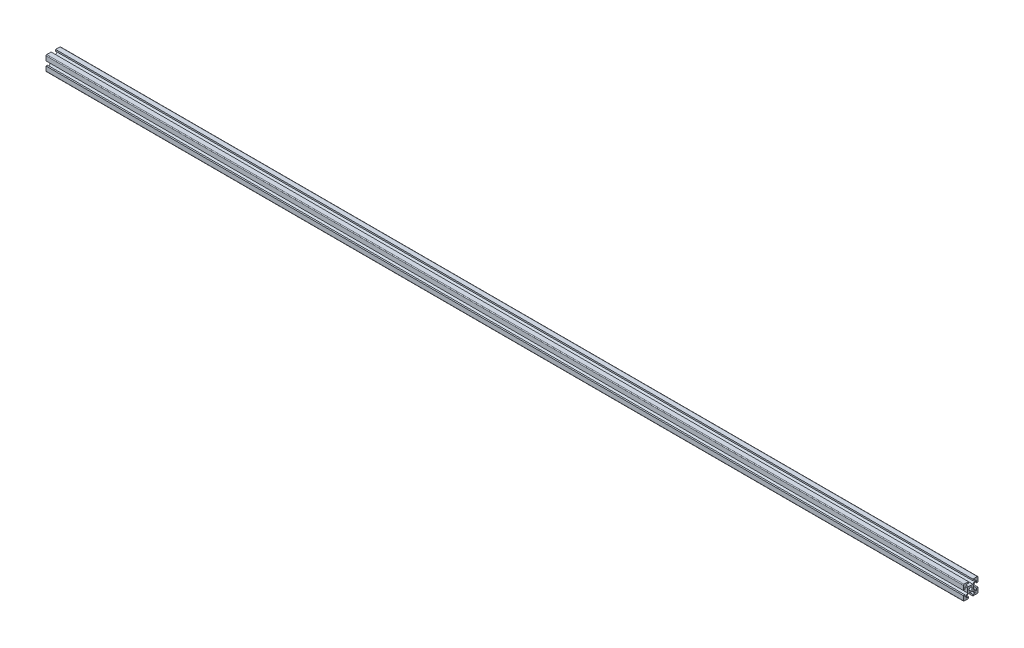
ISO-10303-21;
HEADER;
FILE_DESCRIPTION(('STEP AP214'),'2;1');
FILE_NAME('part.step','',(''),(''),'','','');
FILE_SCHEMA(('AUTOMOTIVE_DESIGN { 1 0 10303 214 1 1 1 1 }'));
ENDSEC;
DATA;
#1=APPLICATION_CONTEXT('core data for automotive mechanical design processes');
#2=APPLICATION_PROTOCOL_DEFINITION('international standard','automotive_design',2000,#1);
#3=PRODUCT_CONTEXT('',#1,'mechanical');
#4=PRODUCT('Part','Part','',(#3));
#5=PRODUCT_RELATED_PRODUCT_CATEGORY('part','',(#4));
#6=PRODUCT_DEFINITION_FORMATION('','',#4);
#7=PRODUCT_DEFINITION_CONTEXT('part definition',#1,'design');
#8=PRODUCT_DEFINITION('design','',#6,#7);
#9=PRODUCT_DEFINITION_SHAPE('','',#8);
#10=(LENGTH_UNIT() NAMED_UNIT(*) SI_UNIT(.MILLI.,.METRE.));
#11=(NAMED_UNIT(*) PLANE_ANGLE_UNIT() SI_UNIT($,.RADIAN.));
#12=(NAMED_UNIT(*) SI_UNIT($,.STERADIAN.) SOLID_ANGLE_UNIT());
#13=UNCERTAINTY_MEASURE_WITH_UNIT(LENGTH_MEASURE(1.E-05),#10,'distance_accuracy_value','');
#14=(GEOMETRIC_REPRESENTATION_CONTEXT(3) GLOBAL_UNCERTAINTY_ASSIGNED_CONTEXT((#13)) GLOBAL_UNIT_ASSIGNED_CONTEXT((#10,
#11,#12)) REPRESENTATION_CONTEXT('',''));
#15=CARTESIAN_POINT('',(0.,0.,0.));
#16=DIRECTION('',(0.,0.,1.));
#17=DIRECTION('',(1.,0.,0.));
#18=AXIS2_PLACEMENT_3D('',#15,#16,#17);
#19=CARTESIAN_POINT('',(1250.,9.,9.));
#20=DIRECTION('',(1.,0.,0.));
#21=DIRECTION('',(0.,0.,-1.));
#22=AXIS2_PLACEMENT_3D('',#19,#20,#21);
#23=PLANE('',#22);
#24=CARTESIAN_POINT('',(1250.,9.,9.));
#25=DIRECTION('',(1.,0.,0.));
#26=DIRECTION('',(0.,0.,-1.));
#27=AXIS2_PLACEMENT_3D('',#24,#25,#26);
#28=CIRCLE('',#27,1.);
#29=CARTESIAN_POINT('',(1250.,10.,9.));
#30=VERTEX_POINT('',#29);
#31=CARTESIAN_POINT('',(1250.,9.,10.));
#32=VERTEX_POINT('',#31);
#33=EDGE_CURVE('E472',#30,#32,#28,.T.);
#34=ORIENTED_EDGE('',*,*,#33,.T.);
#35=DIRECTION('',(0.,-1.,0.));
#36=VECTOR('',#35,1.);
#37=CARTESIAN_POINT('',(1250.,9.,10.));
#38=LINE('',#37,#36);
#39=CARTESIAN_POINT('',(1250.,3.,10.));
#40=VERTEX_POINT('',#39);
#41=EDGE_CURVE('E217',#32,#40,#38,.T.);
#42=ORIENTED_EDGE('',*,*,#41,.T.);
#43=DIRECTION('',(0.,0.,-1.));
#44=VECTOR('',#43,1.);
#45=CARTESIAN_POINT('',(1250.,3.,10.));
#46=LINE('',#45,#44);
#47=CARTESIAN_POINT('',(1250.,3.,8.));
#48=VERTEX_POINT('',#47);
#49=EDGE_CURVE('E607',#40,#48,#46,.T.);
#50=ORIENTED_EDGE('',*,*,#49,.T.);
#51=DIRECTION('',(0.,1.,0.));
#52=VECTOR('',#51,1.);
#53=CARTESIAN_POINT('',(1250.,3.,8.));
#54=LINE('',#53,#52);
#55=CARTESIAN_POINT('',(1250.,6.,8.));
#56=VERTEX_POINT('',#55);
#57=EDGE_CURVE('E623',#48,#56,#54,.T.);
#58=ORIENTED_EDGE('',*,*,#57,.T.);
#59=DIRECTION('',(0.,0.,-1.));
#60=VECTOR('',#59,1.);
#61=CARTESIAN_POINT('',(1250.,6.,8.));
#62=LINE('',#61,#60);
#63=CARTESIAN_POINT('',(1250.,6.,7.06066017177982));
#64=VERTEX_POINT('',#63);
#65=EDGE_CURVE('E625',#56,#64,#62,.T.);
#66=ORIENTED_EDGE('',*,*,#65,.T.);
#67=DIRECTION('',(0.,-0.707106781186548,-0.707106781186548));
#68=VECTOR('',#67,1.);
#69=CARTESIAN_POINT('',(1250.,6.,7.06066017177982));
#70=LINE('',#69,#68);
#71=CARTESIAN_POINT('',(1250.,2.93933982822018,4.));
#72=VERTEX_POINT('',#71);
#73=EDGE_CURVE('E621',#64,#72,#70,.T.);
#74=ORIENTED_EDGE('',*,*,#73,.T.);
#75=DIRECTION('',(0.,-1.,0.));
#76=VECTOR('',#75,1.);
#77=CARTESIAN_POINT('',(1250.,2.93933982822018,4.));
#78=LINE('',#77,#76);
#79=CARTESIAN_POINT('',(1250.,-2.93933982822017,4.));
#80=VERTEX_POINT('',#79);
#81=EDGE_CURVE('E627',#72,#80,#78,.T.);
#82=ORIENTED_EDGE('',*,*,#81,.T.);
#83=DIRECTION('',(0.,-0.707106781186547,0.707106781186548));
#84=VECTOR('',#83,1.);
#85=CARTESIAN_POINT('',(1250.,-2.93933982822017,4.));
#86=LINE('',#85,#84);
#87=CARTESIAN_POINT('',(1250.,-6.,7.06066017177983));
#88=VERTEX_POINT('',#87);
#89=EDGE_CURVE('E631',#80,#88,#86,.T.);
#90=ORIENTED_EDGE('',*,*,#89,.T.);
#91=DIRECTION('',(0.,0.,1.));
#92=VECTOR('',#91,1.);
#93=CARTESIAN_POINT('',(1250.,-6.,7.06066017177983));
#94=LINE('',#93,#92);
#95=CARTESIAN_POINT('',(1250.,-6.,7.99999999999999));
#96=VERTEX_POINT('',#95);
#97=EDGE_CURVE('E634',#88,#96,#94,.T.);
#98=ORIENTED_EDGE('',*,*,#97,.T.);
#99=DIRECTION('',(0.,1.,0.));
#100=VECTOR('',#99,1.);
#101=CARTESIAN_POINT('',(1250.,-6.,7.99999999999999));
#102=LINE('',#101,#100);
#103=CARTESIAN_POINT('',(1250.,-3.,7.99999999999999));
#104=VERTEX_POINT('',#103);
#105=EDGE_CURVE('E640',#96,#104,#102,.T.);
#106=ORIENTED_EDGE('',*,*,#105,.T.);
#107=DIRECTION('',(0.,0.,1.));
#108=VECTOR('',#107,1.);
#109=CARTESIAN_POINT('',(1250.,-3.,7.99999999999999));
#110=LINE('',#109,#108);
#111=CARTESIAN_POINT('',(1250.,-3.,10.));
#112=VERTEX_POINT('',#111);
#113=EDGE_CURVE('E639',#104,#112,#110,.T.);
#114=ORIENTED_EDGE('',*,*,#113,.T.);
#115=DIRECTION('',(0.,-1.,0.));
#116=VECTOR('',#115,1.);
#117=CARTESIAN_POINT('',(1250.,-3.,10.));
#118=LINE('',#117,#116);
#119=CARTESIAN_POINT('',(1250.,-9.,10.));
#120=VERTEX_POINT('',#119);
#121=EDGE_CURVE('E641',#112,#120,#118,.T.);
#122=ORIENTED_EDGE('',*,*,#121,.T.);
#123=CARTESIAN_POINT('',(1250.,-9.,9.));
#124=DIRECTION('',(1.,0.,0.));
#125=DIRECTION('',(0.,0.,-1.));
#126=AXIS2_PLACEMENT_3D('',#123,#124,#125);
#127=CIRCLE('',#126,1.);
#128=CARTESIAN_POINT('',(1250.,-10.,9.));
#129=VERTEX_POINT('',#128);
#130=EDGE_CURVE('E643',#120,#129,#127,.T.);
#131=ORIENTED_EDGE('',*,*,#130,.T.);
#132=DIRECTION('',(0.,0.,-1.));
#133=VECTOR('',#132,1.);
#134=CARTESIAN_POINT('',(1250.,-10.,9.));
#135=LINE('',#134,#133);
#136=CARTESIAN_POINT('',(1250.,-10.,3.));
#137=VERTEX_POINT('',#136);
#138=EDGE_CURVE('E644',#129,#137,#135,.T.);
#139=ORIENTED_EDGE('',*,*,#138,.T.);
#140=DIRECTION('',(0.,1.,0.));
#141=VECTOR('',#140,1.);
#142=CARTESIAN_POINT('',(1250.,-10.,3.));
#143=LINE('',#142,#141);
#144=CARTESIAN_POINT('',(1250.,-8.,3.));
#145=VERTEX_POINT('',#144);
#146=EDGE_CURVE('E650',#137,#145,#143,.T.);
#147=ORIENTED_EDGE('',*,*,#146,.T.);
#148=DIRECTION('',(0.,0.,1.));
#149=VECTOR('',#148,1.);
#150=CARTESIAN_POINT('',(1250.,-8.,3.));
#151=LINE('',#150,#149);
#152=CARTESIAN_POINT('',(1250.,-8.,6.));
#153=VERTEX_POINT('',#152);
#154=EDGE_CURVE('E647',#145,#153,#151,.T.);
#155=ORIENTED_EDGE('',*,*,#154,.T.);
#156=DIRECTION('',(0.,1.,0.));
#157=VECTOR('',#156,1.);
#158=CARTESIAN_POINT('',(1250.,-8.,6.));
#159=LINE('',#158,#157);
#160=CARTESIAN_POINT('',(1250.,-7.06066017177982,6.));
#161=VERTEX_POINT('',#160);
#162=EDGE_CURVE('E651',#153,#161,#159,.T.);
#163=ORIENTED_EDGE('',*,*,#162,.T.);
#164=DIRECTION('',(0.,0.707106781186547,-0.707106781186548));
#165=VECTOR('',#164,1.);
#166=CARTESIAN_POINT('',(1250.,-7.06066017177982,6.));
#167=LINE('',#166,#165);
#168=CARTESIAN_POINT('',(1250.,-4.,2.93933982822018));
#169=VERTEX_POINT('',#168);
#170=EDGE_CURVE('E652',#161,#169,#167,.T.);
#171=ORIENTED_EDGE('',*,*,#170,.T.);
#172=DIRECTION('',(0.,0.,-1.));
#173=VECTOR('',#172,1.);
#174=CARTESIAN_POINT('',(1250.,-4.,2.93933982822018));
#175=LINE('',#174,#173);
#176=CARTESIAN_POINT('',(1250.,-4.,-2.93933982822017));
#177=VERTEX_POINT('',#176);
#178=EDGE_CURVE('E654',#169,#177,#175,.T.);
#179=ORIENTED_EDGE('',*,*,#178,.T.);
#180=DIRECTION('',(0.,-0.707106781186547,-0.707106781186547));
#181=VECTOR('',#180,1.);
#182=CARTESIAN_POINT('',(1250.,-4.,-2.93933982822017));
#183=LINE('',#182,#181);
#184=CARTESIAN_POINT('',(1250.,-7.06066017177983,-6.));
#185=VERTEX_POINT('',#184);
#186=EDGE_CURVE('E660',#177,#185,#183,.T.);
#187=ORIENTED_EDGE('',*,*,#186,.T.);
#188=DIRECTION('',(0.,-1.,0.));
#189=VECTOR('',#188,1.);
#190=CARTESIAN_POINT('',(1250.,-7.06066017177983,-6.));
#191=LINE('',#190,#189);
#192=CARTESIAN_POINT('',(1250.,-7.99999999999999,-6.));
#193=VERTEX_POINT('',#192);
#194=EDGE_CURVE('E656',#185,#193,#191,.T.);
#195=ORIENTED_EDGE('',*,*,#194,.T.);
#196=DIRECTION('',(0.,0.,1.));
#197=VECTOR('',#196,1.);
#198=CARTESIAN_POINT('',(1250.,-7.99999999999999,-6.));
#199=LINE('',#198,#197);
#200=CARTESIAN_POINT('',(1250.,-7.99999999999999,-3.));
#201=VERTEX_POINT('',#200);
#202=EDGE_CURVE('E662',#193,#201,#199,.T.);
#203=ORIENTED_EDGE('',*,*,#202,.T.);
#204=DIRECTION('',(0.,-1.,0.));
#205=VECTOR('',#204,1.);
#206=CARTESIAN_POINT('',(1250.,-7.99999999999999,-3.));
#207=LINE('',#206,#205);
#208=CARTESIAN_POINT('',(1250.,-10.,-3.));
#209=VERTEX_POINT('',#208);
#210=EDGE_CURVE('E663',#201,#209,#207,.T.);
#211=ORIENTED_EDGE('',*,*,#210,.T.);
#212=DIRECTION('',(0.,0.,-1.));
#213=VECTOR('',#212,1.);
#214=CARTESIAN_POINT('',(1250.,-10.,-3.));
#215=LINE('',#214,#213);
#216=CARTESIAN_POINT('',(1250.,-10.,-9.00000000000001));
#217=VERTEX_POINT('',#216);
#218=EDGE_CURVE('E661',#209,#217,#215,.T.);
#219=ORIENTED_EDGE('',*,*,#218,.T.);
#220=CARTESIAN_POINT('',(1250.,-9.,-9.00000000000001));
#221=DIRECTION('',(1.,0.,0.));
#222=DIRECTION('',(0.,0.,-1.));
#223=AXIS2_PLACEMENT_3D('',#220,#221,#222);
#224=CIRCLE('',#223,0.999999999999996);
#225=CARTESIAN_POINT('',(1250.,-9.,-10.));
#226=VERTEX_POINT('',#225);
#227=EDGE_CURVE('E670',#217,#226,#224,.T.);
#228=ORIENTED_EDGE('',*,*,#227,.T.);
#229=DIRECTION('',(0.,1.,0.));
#230=VECTOR('',#229,1.);
#231=CARTESIAN_POINT('',(1250.,-9.,-10.));
#232=LINE('',#231,#230);
#233=CARTESIAN_POINT('',(1250.,-3.,-10.));
#234=VERTEX_POINT('',#233);
#235=EDGE_CURVE('E667',#226,#234,#232,.T.);
#236=ORIENTED_EDGE('',*,*,#235,.T.);
#237=DIRECTION('',(0.,0.,1.));
#238=VECTOR('',#237,1.);
#239=CARTESIAN_POINT('',(1250.,-3.,-10.));
#240=LINE('',#239,#238);
#241=CARTESIAN_POINT('',(1250.,-3.,-8.00000000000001));
#242=VERTEX_POINT('',#241);
#243=EDGE_CURVE('E672',#234,#242,#240,.T.);
#244=ORIENTED_EDGE('',*,*,#243,.T.);
#245=DIRECTION('',(0.,-1.,0.));
#246=VECTOR('',#245,1.);
#247=CARTESIAN_POINT('',(1250.,-3.,-8.00000000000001));
#248=LINE('',#247,#246);
#249=CARTESIAN_POINT('',(1250.,-6.,-8.00000000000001));
#250=VERTEX_POINT('',#249);
#251=EDGE_CURVE('E674',#242,#250,#248,.T.);
#252=ORIENTED_EDGE('',*,*,#251,.T.);
#253=DIRECTION('',(0.,0.,1.));
#254=VECTOR('',#253,1.);
#255=CARTESIAN_POINT('',(1250.,-6.,-8.00000000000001));
#256=LINE('',#255,#254);
#257=CARTESIAN_POINT('',(1250.,-6.,-7.06066017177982));
#258=VERTEX_POINT('',#257);
#259=EDGE_CURVE('E673',#250,#258,#256,.T.);
#260=ORIENTED_EDGE('',*,*,#259,.T.);
#261=DIRECTION('',(0.,0.707106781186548,0.707106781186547));
#262=VECTOR('',#261,1.);
#263=CARTESIAN_POINT('',(1250.,-6.,-7.06066017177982));
#264=LINE('',#263,#262);
#265=CARTESIAN_POINT('',(1250.,-2.93933982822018,-4.));
#266=VERTEX_POINT('',#265);
#267=EDGE_CURVE('E677',#258,#266,#264,.T.);
#268=ORIENTED_EDGE('',*,*,#267,.T.);
#269=DIRECTION('',(0.,1.,0.));
#270=VECTOR('',#269,1.);
#271=CARTESIAN_POINT('',(1250.,-2.93933982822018,-4.));
#272=LINE('',#271,#270);
#273=CARTESIAN_POINT('',(1250.,2.93933982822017,-4.));
#274=VERTEX_POINT('',#273);
#275=EDGE_CURVE('E678',#266,#274,#272,.T.);
#276=ORIENTED_EDGE('',*,*,#275,.T.);
#277=DIRECTION('',(0.,0.707106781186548,-0.707106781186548));
#278=VECTOR('',#277,1.);
#279=CARTESIAN_POINT('',(1250.,2.93933982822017,-4.));
#280=LINE('',#279,#278);
#281=CARTESIAN_POINT('',(1250.,6.,-7.06066017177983));
#282=VERTEX_POINT('',#281);
#283=EDGE_CURVE('E682',#274,#282,#280,.T.);
#284=ORIENTED_EDGE('',*,*,#283,.T.);
#285=DIRECTION('',(0.,0.,-1.));
#286=VECTOR('',#285,1.);
#287=CARTESIAN_POINT('',(1250.,6.,-7.06066017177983));
#288=LINE('',#287,#286);
#289=CARTESIAN_POINT('',(1250.,6.,-7.99999999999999));
#290=VERTEX_POINT('',#289);
#291=EDGE_CURVE('E681',#282,#290,#288,.T.);
#292=ORIENTED_EDGE('',*,*,#291,.T.);
#293=DIRECTION('',(0.,-1.,0.));
#294=VECTOR('',#293,1.);
#295=CARTESIAN_POINT('',(1250.,6.,-7.99999999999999));
#296=LINE('',#295,#294);
#297=CARTESIAN_POINT('',(1250.,3.,-7.99999999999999));
#298=VERTEX_POINT('',#297);
#299=EDGE_CURVE('E683',#290,#298,#296,.T.);
#300=ORIENTED_EDGE('',*,*,#299,.T.);
#301=DIRECTION('',(0.,0.,-1.));
#302=VECTOR('',#301,1.);
#303=CARTESIAN_POINT('',(1250.,3.,-7.99999999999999));
#304=LINE('',#303,#302);
#305=CARTESIAN_POINT('',(1250.,3.,-10.));
#306=VERTEX_POINT('',#305);
#307=EDGE_CURVE('E690',#298,#306,#304,.T.);
#308=ORIENTED_EDGE('',*,*,#307,.T.);
#309=DIRECTION('',(0.,1.,0.));
#310=VECTOR('',#309,1.);
#311=CARTESIAN_POINT('',(1250.,3.,-10.));
#312=LINE('',#311,#310);
#313=CARTESIAN_POINT('',(1250.,9.,-10.));
#314=VERTEX_POINT('',#313);
#315=EDGE_CURVE('E689',#306,#314,#312,.T.);
#316=ORIENTED_EDGE('',*,*,#315,.T.);
#317=CARTESIAN_POINT('',(1250.,9.,-9.00000000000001));
#318=DIRECTION('',(1.,0.,0.));
#319=DIRECTION('',(0.,0.,-1.));
#320=AXIS2_PLACEMENT_3D('',#317,#318,#319);
#321=CIRCLE('',#320,1.);
#322=CARTESIAN_POINT('',(1250.,10.,-9.00000000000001));
#323=VERTEX_POINT('',#322);
#324=EDGE_CURVE('E693',#314,#323,#321,.T.);
#325=ORIENTED_EDGE('',*,*,#324,.T.);
#326=DIRECTION('',(0.,0.,1.));
#327=VECTOR('',#326,1.);
#328=CARTESIAN_POINT('',(1250.,10.,-9.00000000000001));
#329=LINE('',#328,#327);
#330=CARTESIAN_POINT('',(1250.,10.,-3.));
#331=VERTEX_POINT('',#330);
#332=EDGE_CURVE('E691',#323,#331,#329,.T.);
#333=ORIENTED_EDGE('',*,*,#332,.T.);
#334=DIRECTION('',(0.,-1.,0.));
#335=VECTOR('',#334,1.);
#336=CARTESIAN_POINT('',(1250.,10.,-3.));
#337=LINE('',#336,#335);
#338=CARTESIAN_POINT('',(1250.,8.,-3.));
#339=VERTEX_POINT('',#338);
#340=EDGE_CURVE('E694',#331,#339,#337,.T.);
#341=ORIENTED_EDGE('',*,*,#340,.T.);
#342=DIRECTION('',(0.,0.,-1.));
#343=VECTOR('',#342,1.);
#344=CARTESIAN_POINT('',(1250.,8.,-3.));
#345=LINE('',#344,#343);
#346=CARTESIAN_POINT('',(1250.,8.,-6.));
#347=VERTEX_POINT('',#346);
#348=EDGE_CURVE('E700',#339,#347,#345,.T.);
#349=ORIENTED_EDGE('',*,*,#348,.T.);
#350=DIRECTION('',(0.,-1.,0.));
#351=VECTOR('',#350,1.);
#352=CARTESIAN_POINT('',(1250.,8.,-6.));
#353=LINE('',#352,#351);
#354=CARTESIAN_POINT('',(1250.,7.06066017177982,-6.));
#355=VERTEX_POINT('',#354);
#356=EDGE_CURVE('E696',#347,#355,#353,.T.);
#357=ORIENTED_EDGE('',*,*,#356,.T.);
#358=DIRECTION('',(0.,-0.707106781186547,0.707106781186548));
#359=VECTOR('',#358,1.);
#360=CARTESIAN_POINT('',(1250.,7.06066017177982,-6.));
#361=LINE('',#360,#359);
#362=CARTESIAN_POINT('',(1250.,4.,-2.93933982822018));
#363=VERTEX_POINT('',#362);
#364=EDGE_CURVE('E701',#355,#363,#361,.T.);
#365=ORIENTED_EDGE('',*,*,#364,.T.);
#366=DIRECTION('',(0.,0.,1.));
#367=VECTOR('',#366,1.);
#368=CARTESIAN_POINT('',(1250.,4.,-2.93933982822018));
#369=LINE('',#368,#367);
#370=CARTESIAN_POINT('',(1250.,4.,2.93933982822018));
#371=VERTEX_POINT('',#370);
#372=EDGE_CURVE('E704',#363,#371,#369,.T.);
#373=ORIENTED_EDGE('',*,*,#372,.T.);
#374=DIRECTION('',(0.,0.707106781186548,0.707106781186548));
#375=VECTOR('',#374,1.);
#376=CARTESIAN_POINT('',(1250.,4.,2.93933982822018));
#377=LINE('',#376,#375);
#378=CARTESIAN_POINT('',(1250.,7.06066017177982,6.));
#379=VERTEX_POINT('',#378);
#380=EDGE_CURVE('E705',#371,#379,#377,.T.);
#381=ORIENTED_EDGE('',*,*,#380,.T.);
#382=DIRECTION('',(0.,1.,0.));
#383=VECTOR('',#382,1.);
#384=CARTESIAN_POINT('',(1250.,7.06066017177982,6.));
#385=LINE('',#384,#383);
#386=CARTESIAN_POINT('',(1250.,7.99999999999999,6.));
#387=VERTEX_POINT('',#386);
#388=EDGE_CURVE('E359',#379,#387,#385,.T.);
#389=ORIENTED_EDGE('',*,*,#388,.T.);
#390=DIRECTION('',(0.,0.,-1.));
#391=VECTOR('',#390,1.);
#392=CARTESIAN_POINT('',(1250.,7.99999999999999,6.));
#393=LINE('',#392,#391);
#394=CARTESIAN_POINT('',(1250.,7.99999999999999,3.));
#395=VERTEX_POINT('',#394);
#396=EDGE_CURVE('E355',#387,#395,#393,.T.);
#397=ORIENTED_EDGE('',*,*,#396,.T.);
#398=DIRECTION('',(0.,1.,0.));
#399=VECTOR('',#398,1.);
#400=CARTESIAN_POINT('',(1250.,7.99999999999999,3.));
#401=LINE('',#400,#399);
#402=CARTESIAN_POINT('',(1250.,10.,3.));
#403=VERTEX_POINT('',#402);
#404=EDGE_CURVE('E357',#395,#403,#401,.T.);
#405=ORIENTED_EDGE('',*,*,#404,.T.);
#406=DIRECTION('',(0.,0.,1.));
#407=VECTOR('',#406,1.);
#408=CARTESIAN_POINT('',(1250.,10.,3.));
#409=LINE('',#408,#407);
#410=EDGE_CURVE('E57',#403,#30,#409,.T.);
#411=ORIENTED_EDGE('',*,*,#410,.T.);
#412=EDGE_LOOP('',(#34,#42,#50,#58,#66,#74,#82,#90,#98,#106,#114,#122,#131,#139,#147,#155,#163,
#171,#179,#187,#195,#203,#211,#219,#228,#236,#244,#252,#260,#268,#276,#284,#292,#300,#308,#316,
#325,#333,#341,#349,#357,#365,#373,#381,#389,#397,#405,#411));
#413=FACE_BOUND('',#412,.T.);
#414=CARTESIAN_POINT('',(1250.,0.,0.));
#415=DIRECTION('',(1.,0.,0.));
#416=DIRECTION('',(0.,0.,-1.));
#417=AXIS2_PLACEMENT_3D('',#414,#415,#416);
#418=CIRCLE('',#417,2.1);
#419=CARTESIAN_POINT('',(1250.,0.,-2.1));
#420=VERTEX_POINT('',#419);
#421=EDGE_CURVE('E380',#420,#420,#418,.T.);
#422=ORIENTED_EDGE('',*,*,#421,.F.);
#423=EDGE_LOOP('',(#422));
#424=FACE_BOUND('',#423,.T.);
#425=ADVANCED_FACE('F39',(#413,#424),#23,.T.);
#426=CARTESIAN_POINT('',(0.,9.,9.));
#427=DIRECTION('',(1.,0.,0.));
#428=DIRECTION('',(0.,0.,-1.));
#429=AXIS2_PLACEMENT_3D('',#426,#427,#428);
#430=PLANE('',#429);
#431=CARTESIAN_POINT('',(0.,9.,9.));
#432=DIRECTION('',(1.,0.,0.));
#433=DIRECTION('',(0.,0.,-1.));
#434=AXIS2_PLACEMENT_3D('',#431,#432,#433);
#435=CIRCLE('',#434,1.);
#436=CARTESIAN_POINT('',(0.,10.,9.));
#437=VERTEX_POINT('',#436);
#438=CARTESIAN_POINT('',(0.,9.,10.));
#439=VERTEX_POINT('',#438);
#440=EDGE_CURVE('E376',#437,#439,#435,.T.);
#441=ORIENTED_EDGE('',*,*,#440,.F.);
#442=DIRECTION('',(0.,0.,1.));
#443=VECTOR('',#442,1.);
#444=CARTESIAN_POINT('',(0.,10.,3.));
#445=LINE('',#444,#443);
#446=CARTESIAN_POINT('',(0.,10.,3.));
#447=VERTEX_POINT('',#446);
#448=EDGE_CURVE('E212',#447,#437,#445,.T.);
#449=ORIENTED_EDGE('',*,*,#448,.F.);
#450=DIRECTION('',(0.,1.,0.));
#451=VECTOR('',#450,1.);
#452=CARTESIAN_POINT('',(0.,7.99999999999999,3.));
#453=LINE('',#452,#451);
#454=CARTESIAN_POINT('',(0.,7.99999999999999,3.));
#455=VERTEX_POINT('',#454);
#456=EDGE_CURVE('E204',#455,#447,#453,.T.);
#457=ORIENTED_EDGE('',*,*,#456,.F.);
#458=DIRECTION('',(0.,0.,-1.));
#459=VECTOR('',#458,1.);
#460=CARTESIAN_POINT('',(0.,7.99999999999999,6.));
#461=LINE('',#460,#459);
#462=CARTESIAN_POINT('',(0.,7.99999999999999,6.));
#463=VERTEX_POINT('',#462);
#464=EDGE_CURVE('E368',#463,#455,#461,.T.);
#465=ORIENTED_EDGE('',*,*,#464,.F.);
#466=DIRECTION('',(0.,1.,0.));
#467=VECTOR('',#466,1.);
#468=CARTESIAN_POINT('',(0.,7.06066017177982,6.));
#469=LINE('',#468,#467);
#470=CARTESIAN_POINT('',(0.,7.06066017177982,6.));
#471=VERTEX_POINT('',#470);
#472=EDGE_CURVE('E468',#471,#463,#469,.T.);
#473=ORIENTED_EDGE('',*,*,#472,.F.);
#474=DIRECTION('',(0.,0.707106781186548,0.707106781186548));
#475=VECTOR('',#474,1.);
#476=CARTESIAN_POINT('',(0.,4.,2.93933982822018));
#477=LINE('',#476,#475);
#478=CARTESIAN_POINT('',(0.,4.,2.93933982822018));
#479=VERTEX_POINT('',#478);
#480=EDGE_CURVE('E464',#479,#471,#477,.T.);
#481=ORIENTED_EDGE('',*,*,#480,.F.);
#482=DIRECTION('',(0.,0.,1.));
#483=VECTOR('',#482,1.);
#484=CARTESIAN_POINT('',(0.,4.,-2.93933982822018));
#485=LINE('',#484,#483);
#486=CARTESIAN_POINT('',(0.,4.,-2.93933982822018));
#487=VERTEX_POINT('',#486);
#488=EDGE_CURVE('E465',#487,#479,#485,.T.);
#489=ORIENTED_EDGE('',*,*,#488,.F.);
#490=DIRECTION('',(0.,-0.707106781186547,0.707106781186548));
#491=VECTOR('',#490,1.);
#492=CARTESIAN_POINT('',(0.,7.06066017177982,-6.));
#493=LINE('',#492,#491);
#494=CARTESIAN_POINT('',(0.,7.06066017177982,-6.));
#495=VERTEX_POINT('',#494);
#496=EDGE_CURVE('E458',#495,#487,#493,.T.);
#497=ORIENTED_EDGE('',*,*,#496,.F.);
#498=DIRECTION('',(0.,-1.,0.));
#499=VECTOR('',#498,1.);
#500=CARTESIAN_POINT('',(0.,8.,-6.));
#501=LINE('',#500,#499);
#502=CARTESIAN_POINT('',(0.,8.,-6.));
#503=VERTEX_POINT('',#502);
#504=EDGE_CURVE('E456',#503,#495,#501,.T.);
#505=ORIENTED_EDGE('',*,*,#504,.F.);
#506=DIRECTION('',(0.,0.,-1.));
#507=VECTOR('',#506,1.);
#508=CARTESIAN_POINT('',(0.,8.,-3.));
#509=LINE('',#508,#507);
#510=CARTESIAN_POINT('',(0.,8.,-3.));
#511=VERTEX_POINT('',#510);
#512=EDGE_CURVE('E457',#511,#503,#509,.T.);
#513=ORIENTED_EDGE('',*,*,#512,.F.);
#514=DIRECTION('',(0.,-1.,0.));
#515=VECTOR('',#514,1.);
#516=CARTESIAN_POINT('',(0.,10.,-3.));
#517=LINE('',#516,#515);
#518=CARTESIAN_POINT('',(0.,10.,-3.));
#519=VERTEX_POINT('',#518);
#520=EDGE_CURVE('E453',#519,#511,#517,.T.);
#521=ORIENTED_EDGE('',*,*,#520,.F.);
#522=DIRECTION('',(0.,0.,1.));
#523=VECTOR('',#522,1.);
#524=CARTESIAN_POINT('',(0.,10.,-9.00000000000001));
#525=LINE('',#524,#523);
#526=CARTESIAN_POINT('',(0.,10.,-9.00000000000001));
#527=VERTEX_POINT('',#526);
#528=EDGE_CURVE('E452',#527,#519,#525,.T.);
#529=ORIENTED_EDGE('',*,*,#528,.F.);
#530=CARTESIAN_POINT('',(0.,9.,-9.00000000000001));
#531=DIRECTION('',(1.,0.,0.));
#532=DIRECTION('',(0.,0.,-1.));
#533=AXIS2_PLACEMENT_3D('',#530,#531,#532);
#534=CIRCLE('',#533,1.);
#535=CARTESIAN_POINT('',(0.,9.,-10.));
#536=VERTEX_POINT('',#535);
#537=EDGE_CURVE('E448',#536,#527,#534,.T.);
#538=ORIENTED_EDGE('',*,*,#537,.F.);
#539=DIRECTION('',(0.,1.,0.));
#540=VECTOR('',#539,1.);
#541=CARTESIAN_POINT('',(0.,3.,-10.));
#542=LINE('',#541,#540);
#543=CARTESIAN_POINT('',(0.,3.,-10.));
#544=VERTEX_POINT('',#543);
#545=EDGE_CURVE('E449',#544,#536,#542,.T.);
#546=ORIENTED_EDGE('',*,*,#545,.F.);
#547=DIRECTION('',(0.,0.,-1.));
#548=VECTOR('',#547,1.);
#549=CARTESIAN_POINT('',(0.,3.,-7.99999999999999));
#550=LINE('',#549,#548);
#551=CARTESIAN_POINT('',(0.,3.,-7.99999999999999));
#552=VERTEX_POINT('',#551);
#553=EDGE_CURVE('E447',#552,#544,#550,.T.);
#554=ORIENTED_EDGE('',*,*,#553,.F.);
#555=DIRECTION('',(0.,-1.,0.));
#556=VECTOR('',#555,1.);
#557=CARTESIAN_POINT('',(0.,6.,-7.99999999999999));
#558=LINE('',#557,#556);
#559=CARTESIAN_POINT('',(0.,6.,-7.99999999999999));
#560=VERTEX_POINT('',#559);
#561=EDGE_CURVE('E442',#560,#552,#558,.T.);
#562=ORIENTED_EDGE('',*,*,#561,.F.);
#563=DIRECTION('',(0.,0.,-1.));
#564=VECTOR('',#563,1.);
#565=CARTESIAN_POINT('',(0.,6.,-7.06066017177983));
#566=LINE('',#565,#564);
#567=CARTESIAN_POINT('',(0.,6.,-7.06066017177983));
#568=VERTEX_POINT('',#567);
#569=EDGE_CURVE('E445',#568,#560,#566,.T.);
#570=ORIENTED_EDGE('',*,*,#569,.F.);
#571=DIRECTION('',(0.,0.707106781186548,-0.707106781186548));
#572=VECTOR('',#571,1.);
#573=CARTESIAN_POINT('',(0.,2.93933982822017,-4.));
#574=LINE('',#573,#572);
#575=CARTESIAN_POINT('',(0.,2.93933982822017,-4.));
#576=VERTEX_POINT('',#575);
#577=EDGE_CURVE('E436',#576,#568,#574,.T.);
#578=ORIENTED_EDGE('',*,*,#577,.F.);
#579=DIRECTION('',(0.,1.,0.));
#580=VECTOR('',#579,1.);
#581=CARTESIAN_POINT('',(0.,-2.93933982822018,-4.));
#582=LINE('',#581,#580);
#583=CARTESIAN_POINT('',(0.,-2.93933982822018,-4.));
#584=VERTEX_POINT('',#583);
#585=EDGE_CURVE('E438',#584,#576,#582,.T.);
#586=ORIENTED_EDGE('',*,*,#585,.F.);
#587=DIRECTION('',(0.,0.707106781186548,0.707106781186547));
#588=VECTOR('',#587,1.);
#589=CARTESIAN_POINT('',(0.,-6.,-7.06066017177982));
#590=LINE('',#589,#588);
#591=CARTESIAN_POINT('',(0.,-6.,-7.06066017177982));
#592=VERTEX_POINT('',#591);
#593=EDGE_CURVE('E437',#592,#584,#590,.T.);
#594=ORIENTED_EDGE('',*,*,#593,.F.);
#595=DIRECTION('',(0.,0.,1.));
#596=VECTOR('',#595,1.);
#597=CARTESIAN_POINT('',(0.,-6.,-8.00000000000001));
#598=LINE('',#597,#596);
#599=CARTESIAN_POINT('',(0.,-6.,-8.00000000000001));
#600=VERTEX_POINT('',#599);
#601=EDGE_CURVE('E431',#600,#592,#598,.T.);
#602=ORIENTED_EDGE('',*,*,#601,.F.);
#603=DIRECTION('',(0.,-1.,0.));
#604=VECTOR('',#603,1.);
#605=CARTESIAN_POINT('',(0.,-3.,-8.00000000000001));
#606=LINE('',#605,#604);
#607=CARTESIAN_POINT('',(0.,-3.,-8.00000000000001));
#608=VERTEX_POINT('',#607);
#609=EDGE_CURVE('E435',#608,#600,#606,.T.);
#610=ORIENTED_EDGE('',*,*,#609,.F.);
#611=DIRECTION('',(0.,0.,1.));
#612=VECTOR('',#611,1.);
#613=CARTESIAN_POINT('',(0.,-3.,-10.));
#614=LINE('',#613,#612);
#615=CARTESIAN_POINT('',(0.,-3.,-10.));
#616=VERTEX_POINT('',#615);
#617=EDGE_CURVE('E429',#616,#608,#614,.T.);
#618=ORIENTED_EDGE('',*,*,#617,.F.);
#619=DIRECTION('',(0.,1.,0.));
#620=VECTOR('',#619,1.);
#621=CARTESIAN_POINT('',(0.,-9.,-10.));
#622=LINE('',#621,#620);
#623=CARTESIAN_POINT('',(0.,-9.,-10.));
#624=VERTEX_POINT('',#623);
#625=EDGE_CURVE('E427',#624,#616,#622,.T.);
#626=ORIENTED_EDGE('',*,*,#625,.F.);
#627=CARTESIAN_POINT('',(0.,-9.,-9.00000000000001));
#628=DIRECTION('',(1.,0.,0.));
#629=DIRECTION('',(0.,0.,-1.));
#630=AXIS2_PLACEMENT_3D('',#627,#628,#629);
#631=CIRCLE('',#630,0.999999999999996);
#632=CARTESIAN_POINT('',(0.,-10.,-9.00000000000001));
#633=VERTEX_POINT('',#632);
#634=EDGE_CURVE('E426',#633,#624,#631,.T.);
#635=ORIENTED_EDGE('',*,*,#634,.F.);
#636=DIRECTION('',(0.,0.,-1.));
#637=VECTOR('',#636,1.);
#638=CARTESIAN_POINT('',(0.,-10.,-3.));
#639=LINE('',#638,#637);
#640=CARTESIAN_POINT('',(0.,-10.,-3.));
#641=VERTEX_POINT('',#640);
#642=EDGE_CURVE('E422',#641,#633,#639,.T.);
#643=ORIENTED_EDGE('',*,*,#642,.F.);
#644=DIRECTION('',(0.,-1.,0.));
#645=VECTOR('',#644,1.);
#646=CARTESIAN_POINT('',(0.,-7.99999999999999,-3.));
#647=LINE('',#646,#645);
#648=CARTESIAN_POINT('',(0.,-7.99999999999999,-3.));
#649=VERTEX_POINT('',#648);
#650=EDGE_CURVE('E425',#649,#641,#647,.T.);
#651=ORIENTED_EDGE('',*,*,#650,.F.);
#652=DIRECTION('',(0.,0.,1.));
#653=VECTOR('',#652,1.);
#654=CARTESIAN_POINT('',(0.,-7.99999999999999,-6.));
#655=LINE('',#654,#653);
#656=CARTESIAN_POINT('',(0.,-7.99999999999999,-6.));
#657=VERTEX_POINT('',#656);
#658=EDGE_CURVE('E419',#657,#649,#655,.T.);
#659=ORIENTED_EDGE('',*,*,#658,.F.);
#660=DIRECTION('',(0.,-1.,0.));
#661=VECTOR('',#660,1.);
#662=CARTESIAN_POINT('',(0.,-7.06066017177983,-6.));
#663=LINE('',#662,#661);
#664=CARTESIAN_POINT('',(0.,-7.06066017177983,-6.));
#665=VERTEX_POINT('',#664);
#666=EDGE_CURVE('E418',#665,#657,#663,.T.);
#667=ORIENTED_EDGE('',*,*,#666,.F.);
#668=DIRECTION('',(0.,-0.707106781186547,-0.707106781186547));
#669=VECTOR('',#668,1.);
#670=CARTESIAN_POINT('',(0.,-4.,-2.93933982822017));
#671=LINE('',#670,#669);
#672=CARTESIAN_POINT('',(0.,-4.,-2.93933982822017));
#673=VERTEX_POINT('',#672);
#674=EDGE_CURVE('E416',#673,#665,#671,.T.);
#675=ORIENTED_EDGE('',*,*,#674,.F.);
#676=DIRECTION('',(0.,0.,-1.));
#677=VECTOR('',#676,1.);
#678=CARTESIAN_POINT('',(0.,-4.,2.93933982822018));
#679=LINE('',#678,#677);
#680=CARTESIAN_POINT('',(0.,-4.,2.93933982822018));
#681=VERTEX_POINT('',#680);
#682=EDGE_CURVE('E414',#681,#673,#679,.T.);
#683=ORIENTED_EDGE('',*,*,#682,.F.);
#684=DIRECTION('',(0.,0.707106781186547,-0.707106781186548));
#685=VECTOR('',#684,1.);
#686=CARTESIAN_POINT('',(0.,-7.06066017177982,6.));
#687=LINE('',#686,#685);
#688=CARTESIAN_POINT('',(0.,-7.06066017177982,6.));
#689=VERTEX_POINT('',#688);
#690=EDGE_CURVE('E415',#689,#681,#687,.T.);
#691=ORIENTED_EDGE('',*,*,#690,.F.);
#692=DIRECTION('',(0.,1.,0.));
#693=VECTOR('',#692,1.);
#694=CARTESIAN_POINT('',(0.,-8.,6.));
#695=LINE('',#694,#693);
#696=CARTESIAN_POINT('',(0.,-8.,6.));
#697=VERTEX_POINT('',#696);
#698=EDGE_CURVE('E409',#697,#689,#695,.T.);
#699=ORIENTED_EDGE('',*,*,#698,.F.);
#700=DIRECTION('',(0.,0.,1.));
#701=VECTOR('',#700,1.);
#702=CARTESIAN_POINT('',(0.,-8.,3.));
#703=LINE('',#702,#701);
#704=CARTESIAN_POINT('',(0.,-8.,3.));
#705=VERTEX_POINT('',#704);
#706=EDGE_CURVE('E406',#705,#697,#703,.T.);
#707=ORIENTED_EDGE('',*,*,#706,.F.);
#708=DIRECTION('',(0.,1.,0.));
#709=VECTOR('',#708,1.);
#710=CARTESIAN_POINT('',(0.,-10.,3.));
#711=LINE('',#710,#709);
#712=CARTESIAN_POINT('',(0.,-10.,3.));
#713=VERTEX_POINT('',#712);
#714=EDGE_CURVE('E408',#713,#705,#711,.T.);
#715=ORIENTED_EDGE('',*,*,#714,.F.);
#716=DIRECTION('',(0.,0.,-1.));
#717=VECTOR('',#716,1.);
#718=CARTESIAN_POINT('',(0.,-10.,9.));
#719=LINE('',#718,#717);
#720=CARTESIAN_POINT('',(0.,-10.,9.));
#721=VERTEX_POINT('',#720);
#722=EDGE_CURVE('E403',#721,#713,#719,.T.);
#723=ORIENTED_EDGE('',*,*,#722,.F.);
#724=CARTESIAN_POINT('',(0.,-9.,9.));
#725=DIRECTION('',(1.,0.,0.));
#726=DIRECTION('',(0.,0.,-1.));
#727=AXIS2_PLACEMENT_3D('',#724,#725,#726);
#728=CIRCLE('',#727,1.);
#729=CARTESIAN_POINT('',(0.,-9.,10.));
#730=VERTEX_POINT('',#729);
#731=EDGE_CURVE('E402',#730,#721,#728,.T.);
#732=ORIENTED_EDGE('',*,*,#731,.F.);
#733=DIRECTION('',(0.,-1.,0.));
#734=VECTOR('',#733,1.);
#735=CARTESIAN_POINT('',(0.,-3.,10.));
#736=LINE('',#735,#734);
#737=CARTESIAN_POINT('',(0.,-3.,10.));
#738=VERTEX_POINT('',#737);
#739=EDGE_CURVE('E398',#738,#730,#736,.T.);
#740=ORIENTED_EDGE('',*,*,#739,.F.);
#741=DIRECTION('',(0.,0.,1.));
#742=VECTOR('',#741,1.);
#743=CARTESIAN_POINT('',(0.,-3.,7.99999999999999));
#744=LINE('',#743,#742);
#745=CARTESIAN_POINT('',(0.,-3.,7.99999999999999));
#746=VERTEX_POINT('',#745);
#747=EDGE_CURVE('E399',#746,#738,#744,.T.);
#748=ORIENTED_EDGE('',*,*,#747,.F.);
#749=DIRECTION('',(0.,1.,0.));
#750=VECTOR('',#749,1.);
#751=CARTESIAN_POINT('',(0.,-6.,7.99999999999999));
#752=LINE('',#751,#750);
#753=CARTESIAN_POINT('',(0.,-6.,7.99999999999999));
#754=VERTEX_POINT('',#753);
#755=EDGE_CURVE('E397',#754,#746,#752,.T.);
#756=ORIENTED_EDGE('',*,*,#755,.F.);
#757=DIRECTION('',(0.,0.,1.));
#758=VECTOR('',#757,1.);
#759=CARTESIAN_POINT('',(0.,-6.,7.06066017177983));
#760=LINE('',#759,#758);
#761=CARTESIAN_POINT('',(0.,-6.,7.06066017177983));
#762=VERTEX_POINT('',#761);
#763=EDGE_CURVE('E392',#762,#754,#760,.T.);
#764=ORIENTED_EDGE('',*,*,#763,.F.);
#765=DIRECTION('',(0.,-0.707106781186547,0.707106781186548));
#766=VECTOR('',#765,1.);
#767=CARTESIAN_POINT('',(0.,-2.93933982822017,4.));
#768=LINE('',#767,#766);
#769=CARTESIAN_POINT('',(0.,-2.93933982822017,4.));
#770=VERTEX_POINT('',#769);
#771=EDGE_CURVE('E395',#770,#762,#768,.T.);
#772=ORIENTED_EDGE('',*,*,#771,.F.);
#773=DIRECTION('',(0.,-1.,0.));
#774=VECTOR('',#773,1.);
#775=CARTESIAN_POINT('',(0.,2.93933982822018,4.));
#776=LINE('',#775,#774);
#777=CARTESIAN_POINT('',(0.,2.93933982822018,4.));
#778=VERTEX_POINT('',#777);
#779=EDGE_CURVE('E386',#778,#770,#776,.T.);
#780=ORIENTED_EDGE('',*,*,#779,.F.);
#781=DIRECTION('',(0.,-0.707106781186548,-0.707106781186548));
#782=VECTOR('',#781,1.);
#783=CARTESIAN_POINT('',(0.,6.,7.06066017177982));
#784=LINE('',#783,#782);
#785=CARTESIAN_POINT('',(0.,6.,7.06066017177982));
#786=VERTEX_POINT('',#785);
#787=EDGE_CURVE('E388',#786,#778,#784,.T.);
#788=ORIENTED_EDGE('',*,*,#787,.F.);
#789=DIRECTION('',(0.,0.,-1.));
#790=VECTOR('',#789,1.);
#791=CARTESIAN_POINT('',(0.,6.,8.));
#792=LINE('',#791,#790);
#793=CARTESIAN_POINT('',(0.,6.,8.));
#794=VERTEX_POINT('',#793);
#795=EDGE_CURVE('E387',#794,#786,#792,.T.);
#796=ORIENTED_EDGE('',*,*,#795,.F.);
#797=DIRECTION('',(0.,1.,0.));
#798=VECTOR('',#797,1.);
#799=CARTESIAN_POINT('',(0.,3.,8.));
#800=LINE('',#799,#798);
#801=CARTESIAN_POINT('',(0.,3.,8.));
#802=VERTEX_POINT('',#801);
#803=EDGE_CURVE('E384',#802,#794,#800,.T.);
#804=ORIENTED_EDGE('',*,*,#803,.F.);
#805=DIRECTION('',(0.,0.,-1.));
#806=VECTOR('',#805,1.);
#807=CARTESIAN_POINT('',(0.,3.,10.));
#808=LINE('',#807,#806);
#809=CARTESIAN_POINT('',(0.,3.,10.));
#810=VERTEX_POINT('',#809);
#811=EDGE_CURVE('E385',#810,#802,#808,.T.);
#812=ORIENTED_EDGE('',*,*,#811,.F.);
#813=DIRECTION('',(0.,-1.,0.));
#814=VECTOR('',#813,1.);
#815=CARTESIAN_POINT('',(0.,9.,10.));
#816=LINE('',#815,#814);
#817=EDGE_CURVE('E378',#439,#810,#816,.T.);
#818=ORIENTED_EDGE('',*,*,#817,.F.);
#819=EDGE_LOOP('',(#441,#449,#457,#465,#473,#481,#489,#497,#505,#513,#521,#529,#538,#546,#554,
#562,#570,#578,#586,#594,#602,#610,#618,#626,#635,#643,#651,#659,#667,#675,#683,#691,#699,#707,
#715,#723,#732,#740,#748,#756,#764,#772,#780,#788,#796,#804,#812,#818));
#820=FACE_BOUND('',#819,.T.);
#821=CARTESIAN_POINT('',(0.,0.,0.));
#822=DIRECTION('',(1.,0.,0.));
#823=DIRECTION('',(0.,0.,-1.));
#824=AXIS2_PLACEMENT_3D('',#821,#822,#823);
#825=CIRCLE('',#824,2.1);
#826=CARTESIAN_POINT('',(0.,0.,-2.1));
#827=VERTEX_POINT('',#826);
#828=EDGE_CURVE('E1238',#827,#827,#825,.T.);
#829=ORIENTED_EDGE('',*,*,#828,.T.);
#830=EDGE_LOOP('',(#829));
#831=FACE_BOUND('',#830,.T.);
#832=ADVANCED_FACE('F608',(#820,#831),#430,.F.);
#833=CARTESIAN_POINT('',(1250.,9.,9.));
#834=DIRECTION('',(-1.,0.,0.));
#835=DIRECTION('',(0.,0.,1.));
#836=AXIS2_PLACEMENT_3D('',#833,#834,#835);
#837=CYLINDRICAL_SURFACE('',#836,1.);
#838=ORIENTED_EDGE('',*,*,#440,.T.);
#839=DIRECTION('',(-1.,0.,0.));
#840=VECTOR('',#839,1.);
#841=CARTESIAN_POINT('',(1250.,9.,10.));
#842=LINE('',#841,#840);
#843=EDGE_CURVE('E11',#32,#439,#842,.T.);
#844=ORIENTED_EDGE('',*,*,#843,.F.);
#845=ORIENTED_EDGE('',*,*,#33,.F.);
#846=DIRECTION('',(-1.,0.,0.));
#847=VECTOR('',#846,1.);
#848=CARTESIAN_POINT('',(1250.,10.,9.));
#849=LINE('',#848,#847);
#850=EDGE_CURVE('E375',#30,#437,#849,.T.);
#851=ORIENTED_EDGE('',*,*,#850,.T.);
#852=EDGE_LOOP('',(#838,#844,#845,#851));
#853=FACE_BOUND('',#852,.T.);
#854=ADVANCED_FACE('F41',(#853),#837,.T.);
#855=CARTESIAN_POINT('',(1250.,9.,10.));
#856=DIRECTION('',(0.,0.,-1.));
#857=DIRECTION('',(-1.,0.,0.));
#858=AXIS2_PLACEMENT_3D('',#855,#856,#857);
#859=PLANE('',#858);
#860=ORIENTED_EDGE('',*,*,#817,.T.);
#861=DIRECTION('',(-1.,0.,0.));
#862=VECTOR('',#861,1.);
#863=CARTESIAN_POINT('',(1250.,3.,10.));
#864=LINE('',#863,#862);
#865=EDGE_CURVE('E48',#40,#810,#864,.T.);
#866=ORIENTED_EDGE('',*,*,#865,.F.);
#867=ORIENTED_EDGE('',*,*,#41,.F.);
#868=ORIENTED_EDGE('',*,*,#843,.T.);
#869=EDGE_LOOP('',(#860,#866,#867,#868));
#870=FACE_BOUND('',#869,.T.);
#871=ADVANCED_FACE('F736',(#870),#859,.F.);
#872=CARTESIAN_POINT('',(1250.,3.,10.));
#873=DIRECTION('',(0.,1.,0.));
#874=DIRECTION('',(0.,0.,1.));
#875=AXIS2_PLACEMENT_3D('',#872,#873,#874);
#876=PLANE('',#875);
#877=ORIENTED_EDGE('',*,*,#811,.T.);
#878=DIRECTION('',(-1.,0.,0.));
#879=VECTOR('',#878,1.);
#880=CARTESIAN_POINT('',(1250.,3.,8.));
#881=LINE('',#880,#879);
#882=EDGE_CURVE('E599',#48,#802,#881,.T.);
#883=ORIENTED_EDGE('',*,*,#882,.F.);
#884=ORIENTED_EDGE('',*,*,#49,.F.);
#885=ORIENTED_EDGE('',*,*,#865,.T.);
#886=EDGE_LOOP('',(#877,#883,#884,#885));
#887=FACE_BOUND('',#886,.T.);
#888=ADVANCED_FACE('F603',(#887),#876,.F.);
#889=CARTESIAN_POINT('',(1250.,3.,8.));
#890=DIRECTION('',(0.,0.,1.));
#891=DIRECTION('',(1.,0.,0.));
#892=AXIS2_PLACEMENT_3D('',#889,#890,#891);
#893=PLANE('',#892);
#894=ORIENTED_EDGE('',*,*,#803,.T.);
#895=DIRECTION('',(-1.,0.,0.));
#896=VECTOR('',#895,1.);
#897=CARTESIAN_POINT('',(1250.,6.,8.));
#898=LINE('',#897,#896);
#899=EDGE_CURVE('E594',#56,#794,#898,.T.);
#900=ORIENTED_EDGE('',*,*,#899,.F.);
#901=ORIENTED_EDGE('',*,*,#57,.F.);
#902=ORIENTED_EDGE('',*,*,#882,.T.);
#903=EDGE_LOOP('',(#894,#900,#901,#902));
#904=FACE_BOUND('',#903,.T.);
#905=ADVANCED_FACE('F618',(#904),#893,.F.);
#906=CARTESIAN_POINT('',(1250.,6.,8.));
#907=DIRECTION('',(0.,1.,0.));
#908=DIRECTION('',(0.,0.,1.));
#909=AXIS2_PLACEMENT_3D('',#906,#907,#908);
#910=PLANE('',#909);
#911=ORIENTED_EDGE('',*,*,#795,.T.);
#912=DIRECTION('',(-1.,0.,0.));
#913=VECTOR('',#912,1.);
#914=CARTESIAN_POINT('',(1250.,6.,7.06066017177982));
#915=LINE('',#914,#913);
#916=EDGE_CURVE('E595',#64,#786,#915,.T.);
#917=ORIENTED_EDGE('',*,*,#916,.F.);
#918=ORIENTED_EDGE('',*,*,#65,.F.);
#919=ORIENTED_EDGE('',*,*,#899,.T.);
#920=EDGE_LOOP('',(#911,#917,#918,#919));
#921=FACE_BOUND('',#920,.T.);
#922=ADVANCED_FACE('F619',(#921),#910,.F.);
#923=CARTESIAN_POINT('',(1250.,6.,7.06066017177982));
#924=DIRECTION('',(0.,0.707106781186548,-0.707106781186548));
#925=DIRECTION('',(0.,0.707106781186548,0.707106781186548));
#926=AXIS2_PLACEMENT_3D('',#923,#924,#925);
#927=PLANE('',#926);
#928=ORIENTED_EDGE('',*,*,#787,.T.);
#929=DIRECTION('',(-1.,0.,0.));
#930=VECTOR('',#929,1.);
#931=CARTESIAN_POINT('',(1250.,2.93933982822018,4.));
#932=LINE('',#931,#930);
#933=EDGE_CURVE('E589',#72,#778,#932,.T.);
#934=ORIENTED_EDGE('',*,*,#933,.F.);
#935=ORIENTED_EDGE('',*,*,#73,.F.);
#936=ORIENTED_EDGE('',*,*,#916,.T.);
#937=EDGE_LOOP('',(#928,#934,#935,#936));
#938=FACE_BOUND('',#937,.T.);
#939=ADVANCED_FACE('F754',(#938),#927,.F.);
#940=CARTESIAN_POINT('',(1250.,2.93933982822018,4.));
#941=DIRECTION('',(0.,0.,-1.));
#942=DIRECTION('',(-1.,0.,0.));
#943=AXIS2_PLACEMENT_3D('',#940,#941,#942);
#944=PLANE('',#943);
#945=ORIENTED_EDGE('',*,*,#779,.T.);
#946=DIRECTION('',(-1.,0.,0.));
#947=VECTOR('',#946,1.);
#948=CARTESIAN_POINT('',(1250.,-2.93933982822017,4.));
#949=LINE('',#948,#947);
#950=EDGE_CURVE('E587',#80,#770,#949,.T.);
#951=ORIENTED_EDGE('',*,*,#950,.F.);
#952=ORIENTED_EDGE('',*,*,#81,.F.);
#953=ORIENTED_EDGE('',*,*,#933,.T.);
#954=EDGE_LOOP('',(#945,#951,#952,#953));
#955=FACE_BOUND('',#954,.T.);
#956=ADVANCED_FACE('F757',(#955),#944,.F.);
#957=CARTESIAN_POINT('',(1250.,-2.93933982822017,4.));
#958=DIRECTION('',(0.,-0.707106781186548,-0.707106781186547));
#959=DIRECTION('',(0.,0.707106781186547,-0.707106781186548));
#960=AXIS2_PLACEMENT_3D('',#957,#958,#959);
#961=PLANE('',#960);
#962=ORIENTED_EDGE('',*,*,#771,.T.);
#963=DIRECTION('',(-1.,0.,0.));
#964=VECTOR('',#963,1.);
#965=CARTESIAN_POINT('',(1250.,-6.,7.06066017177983));
#966=LINE('',#965,#964);
#967=EDGE_CURVE('E584',#88,#762,#966,.T.);
#968=ORIENTED_EDGE('',*,*,#967,.F.);
#969=ORIENTED_EDGE('',*,*,#89,.F.);
#970=ORIENTED_EDGE('',*,*,#950,.T.);
#971=EDGE_LOOP('',(#962,#968,#969,#970));
#972=FACE_BOUND('',#971,.T.);
#973=ADVANCED_FACE('F758',(#972),#961,.F.);
#974=CARTESIAN_POINT('',(1250.,-6.,7.06066017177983));
#975=DIRECTION('',(0.,-1.,0.));
#976=DIRECTION('',(0.,0.,-1.));
#977=AXIS2_PLACEMENT_3D('',#974,#975,#976);
#978=PLANE('',#977);
#979=ORIENTED_EDGE('',*,*,#763,.T.);
#980=DIRECTION('',(-1.,0.,0.));
#981=VECTOR('',#980,1.);
#982=CARTESIAN_POINT('',(1250.,-6.,7.99999999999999));
#983=LINE('',#982,#981);
#984=EDGE_CURVE('E579',#96,#754,#983,.T.);
#985=ORIENTED_EDGE('',*,*,#984,.F.);
#986=ORIENTED_EDGE('',*,*,#97,.F.);
#987=ORIENTED_EDGE('',*,*,#967,.T.);
#988=EDGE_LOOP('',(#979,#985,#986,#987));
#989=FACE_BOUND('',#988,.T.);
#990=ADVANCED_FACE('F764',(#989),#978,.F.);
#991=CARTESIAN_POINT('',(1250.,-6.,7.99999999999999));
#992=DIRECTION('',(0.,0.,1.));
#993=DIRECTION('',(1.,0.,0.));
#994=AXIS2_PLACEMENT_3D('',#991,#992,#993);
#995=PLANE('',#994);
#996=ORIENTED_EDGE('',*,*,#755,.T.);
#997=DIRECTION('',(-1.,0.,0.));
#998=VECTOR('',#997,1.);
#999=CARTESIAN_POINT('',(1250.,-3.,7.99999999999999));
#1000=LINE('',#999,#998);
#1001=EDGE_CURVE('E580',#104,#746,#1000,.T.);
#1002=ORIENTED_EDGE('',*,*,#1001,.F.);
#1003=ORIENTED_EDGE('',*,*,#105,.F.);
#1004=ORIENTED_EDGE('',*,*,#984,.T.);
#1005=EDGE_LOOP('',(#996,#1002,#1003,#1004));
#1006=FACE_BOUND('',#1005,.T.);
#1007=ADVANCED_FACE('F766',(#1006),#995,.F.);
#1008=CARTESIAN_POINT('',(1250.,-3.,7.99999999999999));
#1009=DIRECTION('',(0.,-1.,0.));
#1010=DIRECTION('',(0.,0.,-1.));
#1011=AXIS2_PLACEMENT_3D('',#1008,#1009,#1010);
#1012=PLANE('',#1011);
#1013=ORIENTED_EDGE('',*,*,#747,.T.);
#1014=DIRECTION('',(-1.,0.,0.));
#1015=VECTOR('',#1014,1.);
#1016=CARTESIAN_POINT('',(1250.,-3.,10.));
#1017=LINE('',#1016,#1015);
#1018=EDGE_CURVE('E572',#112,#738,#1017,.T.);
#1019=ORIENTED_EDGE('',*,*,#1018,.F.);
#1020=ORIENTED_EDGE('',*,*,#113,.F.);
#1021=ORIENTED_EDGE('',*,*,#1001,.T.);
#1022=EDGE_LOOP('',(#1013,#1019,#1020,#1021));
#1023=FACE_BOUND('',#1022,.T.);
#1024=ADVANCED_FACE('F775',(#1023),#1012,.F.);
#1025=CARTESIAN_POINT('',(1250.,-3.,10.));
#1026=DIRECTION('',(0.,0.,-1.));
#1027=DIRECTION('',(-1.,0.,0.));
#1028=AXIS2_PLACEMENT_3D('',#1025,#1026,#1027);
#1029=PLANE('',#1028);
#1030=ORIENTED_EDGE('',*,*,#739,.T.);
#1031=DIRECTION('',(-1.,0.,0.));
#1032=VECTOR('',#1031,1.);
#1033=CARTESIAN_POINT('',(1250.,-9.,10.));
#1034=LINE('',#1033,#1032);
#1035=EDGE_CURVE('E571',#120,#730,#1034,.T.);
#1036=ORIENTED_EDGE('',*,*,#1035,.F.);
#1037=ORIENTED_EDGE('',*,*,#121,.F.);
#1038=ORIENTED_EDGE('',*,*,#1018,.T.);
#1039=EDGE_LOOP('',(#1030,#1036,#1037,#1038));
#1040=FACE_BOUND('',#1039,.T.);
#1041=ADVANCED_FACE('F776',(#1040),#1029,.F.);
#1042=CARTESIAN_POINT('',(1250.,-9.,9.));
#1043=DIRECTION('',(-1.,0.,0.));
#1044=DIRECTION('',(0.,0.,1.));
#1045=AXIS2_PLACEMENT_3D('',#1042,#1043,#1044);
#1046=CYLINDRICAL_SURFACE('',#1045,1.);
#1047=ORIENTED_EDGE('',*,*,#731,.T.);
#1048=DIRECTION('',(-1.,0.,0.));
#1049=VECTOR('',#1048,1.);
#1050=CARTESIAN_POINT('',(1250.,-10.,9.));
#1051=LINE('',#1050,#1049);
#1052=EDGE_CURVE('E568',#129,#721,#1051,.T.);
#1053=ORIENTED_EDGE('',*,*,#1052,.F.);
#1054=ORIENTED_EDGE('',*,*,#130,.F.);
#1055=ORIENTED_EDGE('',*,*,#1035,.T.);
#1056=EDGE_LOOP('',(#1047,#1053,#1054,#1055));
#1057=FACE_BOUND('',#1056,.T.);
#1058=ADVANCED_FACE('F780',(#1057),#1046,.T.);
#1059=CARTESIAN_POINT('',(1250.,-10.,9.));
#1060=DIRECTION('',(0.,1.,0.));
#1061=DIRECTION('',(0.,0.,1.));
#1062=AXIS2_PLACEMENT_3D('',#1059,#1060,#1061);
#1063=PLANE('',#1062);
#1064=ORIENTED_EDGE('',*,*,#722,.T.);
#1065=DIRECTION('',(-1.,0.,0.));
#1066=VECTOR('',#1065,1.);
#1067=CARTESIAN_POINT('',(1250.,-10.,3.));
#1068=LINE('',#1067,#1066);
#1069=EDGE_CURVE('E562',#137,#713,#1068,.T.);
#1070=ORIENTED_EDGE('',*,*,#1069,.F.);
#1071=ORIENTED_EDGE('',*,*,#138,.F.);
#1072=ORIENTED_EDGE('',*,*,#1052,.T.);
#1073=EDGE_LOOP('',(#1064,#1070,#1071,#1072));
#1074=FACE_BOUND('',#1073,.T.);
#1075=ADVANCED_FACE('F785',(#1074),#1063,.F.);
#1076=CARTESIAN_POINT('',(1250.,-10.,3.));
#1077=DIRECTION('',(0.,0.,1.));
#1078=DIRECTION('',(1.,0.,0.));
#1079=AXIS2_PLACEMENT_3D('',#1076,#1077,#1078);
#1080=PLANE('',#1079);
#1081=ORIENTED_EDGE('',*,*,#714,.T.);
#1082=DIRECTION('',(-1.,0.,0.));
#1083=VECTOR('',#1082,1.);
#1084=CARTESIAN_POINT('',(1250.,-8.,3.));
#1085=LINE('',#1084,#1083);
#1086=EDGE_CURVE('E565',#145,#705,#1085,.T.);
#1087=ORIENTED_EDGE('',*,*,#1086,.F.);
#1088=ORIENTED_EDGE('',*,*,#146,.F.);
#1089=ORIENTED_EDGE('',*,*,#1069,.T.);
#1090=EDGE_LOOP('',(#1081,#1087,#1088,#1089));
#1091=FACE_BOUND('',#1090,.T.);
#1092=ADVANCED_FACE('F786',(#1091),#1080,.F.);
#1093=CARTESIAN_POINT('',(1250.,-8.,3.));
#1094=DIRECTION('',(0.,-1.,0.));
#1095=DIRECTION('',(0.,0.,-1.));
#1096=AXIS2_PLACEMENT_3D('',#1093,#1094,#1095);
#1097=PLANE('',#1096);
#1098=ORIENTED_EDGE('',*,*,#706,.T.);
#1099=DIRECTION('',(-1.,0.,0.));
#1100=VECTOR('',#1099,1.);
#1101=CARTESIAN_POINT('',(1250.,-8.,6.));
#1102=LINE('',#1101,#1100);
#1103=EDGE_CURVE('E560',#153,#697,#1102,.T.);
#1104=ORIENTED_EDGE('',*,*,#1103,.F.);
#1105=ORIENTED_EDGE('',*,*,#154,.F.);
#1106=ORIENTED_EDGE('',*,*,#1086,.T.);
#1107=EDGE_LOOP('',(#1098,#1104,#1105,#1106));
#1108=FACE_BOUND('',#1107,.T.);
#1109=ADVANCED_FACE('F795',(#1108),#1097,.F.);
#1110=CARTESIAN_POINT('',(1250.,-8.,6.));
#1111=DIRECTION('',(0.,0.,1.));
#1112=DIRECTION('',(1.,0.,0.));
#1113=AXIS2_PLACEMENT_3D('',#1110,#1111,#1112);
#1114=PLANE('',#1113);
#1115=ORIENTED_EDGE('',*,*,#698,.T.);
#1116=DIRECTION('',(-1.,0.,0.));
#1117=VECTOR('',#1116,1.);
#1118=CARTESIAN_POINT('',(1250.,-7.06066017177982,6.));
#1119=LINE('',#1118,#1117);
#1120=EDGE_CURVE('E558',#161,#689,#1119,.T.);
#1121=ORIENTED_EDGE('',*,*,#1120,.F.);
#1122=ORIENTED_EDGE('',*,*,#162,.F.);
#1123=ORIENTED_EDGE('',*,*,#1103,.T.);
#1124=EDGE_LOOP('',(#1115,#1121,#1122,#1123));
#1125=FACE_BOUND('',#1124,.T.);
#1126=ADVANCED_FACE('F796',(#1125),#1114,.F.);
#1127=CARTESIAN_POINT('',(1250.,-7.06066017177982,6.));
#1128=DIRECTION('',(0.,0.707106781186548,0.707106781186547));
#1129=DIRECTION('',(0.,-0.707106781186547,0.707106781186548));
#1130=AXIS2_PLACEMENT_3D('',#1127,#1128,#1129);
#1131=PLANE('',#1130);
#1132=ORIENTED_EDGE('',*,*,#690,.T.);
#1133=DIRECTION('',(-1.,0.,0.));
#1134=VECTOR('',#1133,1.);
#1135=CARTESIAN_POINT('',(1250.,-4.,2.93933982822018));
#1136=LINE('',#1135,#1134);
#1137=EDGE_CURVE('E554',#169,#681,#1136,.T.);
#1138=ORIENTED_EDGE('',*,*,#1137,.F.);
#1139=ORIENTED_EDGE('',*,*,#170,.F.);
#1140=ORIENTED_EDGE('',*,*,#1120,.T.);
#1141=EDGE_LOOP('',(#1132,#1138,#1139,#1140));
#1142=FACE_BOUND('',#1141,.T.);
#1143=ADVANCED_FACE('F799',(#1142),#1131,.F.);
#1144=CARTESIAN_POINT('',(1250.,-4.,2.93933982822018));
#1145=DIRECTION('',(0.,1.,0.));
#1146=DIRECTION('',(0.,0.,1.));
#1147=AXIS2_PLACEMENT_3D('',#1144,#1145,#1146);
#1148=PLANE('',#1147);
#1149=ORIENTED_EDGE('',*,*,#682,.T.);
#1150=DIRECTION('',(-1.,0.,0.));
#1151=VECTOR('',#1150,1.);
#1152=CARTESIAN_POINT('',(1250.,-4.,-2.93933982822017));
#1153=LINE('',#1152,#1151);
#1154=EDGE_CURVE('E548',#177,#673,#1153,.T.);
#1155=ORIENTED_EDGE('',*,*,#1154,.F.);
#1156=ORIENTED_EDGE('',*,*,#178,.F.);
#1157=ORIENTED_EDGE('',*,*,#1137,.T.);
#1158=EDGE_LOOP('',(#1149,#1155,#1156,#1157));
#1159=FACE_BOUND('',#1158,.T.);
#1160=ADVANCED_FACE('F803',(#1159),#1148,.F.);
#1161=CARTESIAN_POINT('',(1250.,-4.,-2.93933982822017));
#1162=DIRECTION('',(0.,0.707106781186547,-0.707106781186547));
#1163=DIRECTION('',(0.,0.707106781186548,0.707106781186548));
#1164=AXIS2_PLACEMENT_3D('',#1161,#1162,#1163);
#1165=PLANE('',#1164);
#1166=ORIENTED_EDGE('',*,*,#674,.T.);
#1167=DIRECTION('',(-1.,0.,0.));
#1168=VECTOR('',#1167,1.);
#1169=CARTESIAN_POINT('',(1250.,-7.06066017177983,-6.));
#1170=LINE('',#1169,#1168);
#1171=EDGE_CURVE('E550',#185,#665,#1170,.T.);
#1172=ORIENTED_EDGE('',*,*,#1171,.F.);
#1173=ORIENTED_EDGE('',*,*,#186,.F.);
#1174=ORIENTED_EDGE('',*,*,#1154,.T.);
#1175=EDGE_LOOP('',(#1166,#1172,#1173,#1174));
#1176=FACE_BOUND('',#1175,.T.);
#1177=ADVANCED_FACE('F809',(#1176),#1165,.F.);
#1178=CARTESIAN_POINT('',(1250.,-7.06066017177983,-6.));
#1179=DIRECTION('',(0.,0.,-1.));
#1180=DIRECTION('',(-1.,0.,0.));
#1181=AXIS2_PLACEMENT_3D('',#1178,#1179,#1180);
#1182=PLANE('',#1181);
#1183=ORIENTED_EDGE('',*,*,#666,.T.);
#1184=DIRECTION('',(-1.,0.,0.));
#1185=VECTOR('',#1184,1.);
#1186=CARTESIAN_POINT('',(1250.,-7.99999999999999,-6.));
#1187=LINE('',#1186,#1185);
#1188=EDGE_CURVE('E542',#193,#657,#1187,.T.);
#1189=ORIENTED_EDGE('',*,*,#1188,.F.);
#1190=ORIENTED_EDGE('',*,*,#194,.F.);
#1191=ORIENTED_EDGE('',*,*,#1171,.T.);
#1192=EDGE_LOOP('',(#1183,#1189,#1190,#1191));
#1193=FACE_BOUND('',#1192,.T.);
#1194=ADVANCED_FACE('F815',(#1193),#1182,.F.);
#1195=CARTESIAN_POINT('',(1250.,-7.99999999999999,-6.));
#1196=DIRECTION('',(0.,-1.,0.));
#1197=DIRECTION('',(0.,0.,-1.));
#1198=AXIS2_PLACEMENT_3D('',#1195,#1196,#1197);
#1199=PLANE('',#1198);
#1200=ORIENTED_EDGE('',*,*,#658,.T.);
#1201=DIRECTION('',(-1.,0.,0.));
#1202=VECTOR('',#1201,1.);
#1203=CARTESIAN_POINT('',(1250.,-7.99999999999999,-3.));
#1204=LINE('',#1203,#1202);
#1205=EDGE_CURVE('E543',#201,#649,#1204,.T.);
#1206=ORIENTED_EDGE('',*,*,#1205,.F.);
#1207=ORIENTED_EDGE('',*,*,#202,.F.);
#1208=ORIENTED_EDGE('',*,*,#1188,.T.);
#1209=EDGE_LOOP('',(#1200,#1206,#1207,#1208));
#1210=FACE_BOUND('',#1209,.T.);
#1211=ADVANCED_FACE('F818',(#1210),#1199,.F.);
#1212=CARTESIAN_POINT('',(1250.,-7.99999999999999,-3.));
#1213=DIRECTION('',(0.,0.,-1.));
#1214=DIRECTION('',(-1.,0.,0.));
#1215=AXIS2_PLACEMENT_3D('',#1212,#1213,#1214);
#1216=PLANE('',#1215);
#1217=ORIENTED_EDGE('',*,*,#650,.T.);
#1218=DIRECTION('',(-1.,0.,0.));
#1219=VECTOR('',#1218,1.);
#1220=CARTESIAN_POINT('',(1250.,-10.,-3.));
#1221=LINE('',#1220,#1219);
#1222=EDGE_CURVE('E538',#209,#641,#1221,.T.);
#1223=ORIENTED_EDGE('',*,*,#1222,.F.);
#1224=ORIENTED_EDGE('',*,*,#210,.F.);
#1225=ORIENTED_EDGE('',*,*,#1205,.T.);
#1226=EDGE_LOOP('',(#1217,#1223,#1224,#1225));
#1227=FACE_BOUND('',#1226,.T.);
#1228=ADVANCED_FACE('F819',(#1227),#1216,.F.);
#1229=CARTESIAN_POINT('',(1250.,-10.,-3.));
#1230=DIRECTION('',(0.,1.,0.));
#1231=DIRECTION('',(0.,0.,1.));
#1232=AXIS2_PLACEMENT_3D('',#1229,#1230,#1231);
#1233=PLANE('',#1232);
#1234=ORIENTED_EDGE('',*,*,#642,.T.);
#1235=DIRECTION('',(-1.,0.,0.));
#1236=VECTOR('',#1235,1.);
#1237=CARTESIAN_POINT('',(1250.,-10.,-9.00000000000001));
#1238=LINE('',#1237,#1236);
#1239=EDGE_CURVE('E533',#217,#633,#1238,.T.);
#1240=ORIENTED_EDGE('',*,*,#1239,.F.);
#1241=ORIENTED_EDGE('',*,*,#218,.F.);
#1242=ORIENTED_EDGE('',*,*,#1222,.T.);
#1243=EDGE_LOOP('',(#1234,#1240,#1241,#1242));
#1244=FACE_BOUND('',#1243,.T.);
#1245=ADVANCED_FACE('F821',(#1244),#1233,.F.);
#1246=CARTESIAN_POINT('',(1250.,-9.,-9.00000000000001));
#1247=DIRECTION('',(-1.,0.,0.));
#1248=DIRECTION('',(0.,0.,1.));
#1249=AXIS2_PLACEMENT_3D('',#1246,#1247,#1248);
#1250=CYLINDRICAL_SURFACE('',#1249,0.999999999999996);
#1251=ORIENTED_EDGE('',*,*,#634,.T.);
#1252=DIRECTION('',(-1.,0.,0.));
#1253=VECTOR('',#1252,1.);
#1254=CARTESIAN_POINT('',(1250.,-9.,-10.));
#1255=LINE('',#1254,#1253);
#1256=EDGE_CURVE('E535',#226,#624,#1255,.T.);
#1257=ORIENTED_EDGE('',*,*,#1256,.F.);
#1258=ORIENTED_EDGE('',*,*,#227,.F.);
#1259=ORIENTED_EDGE('',*,*,#1239,.T.);
#1260=EDGE_LOOP('',(#1251,#1257,#1258,#1259));
#1261=FACE_BOUND('',#1260,.T.);
#1262=ADVANCED_FACE('F829',(#1261),#1250,.T.);
#1263=CARTESIAN_POINT('',(1250.,-9.,-10.));
#1264=DIRECTION('',(0.,0.,1.));
#1265=DIRECTION('',(1.,0.,0.));
#1266=AXIS2_PLACEMENT_3D('',#1263,#1264,#1265);
#1267=PLANE('',#1266);
#1268=ORIENTED_EDGE('',*,*,#625,.T.);
#1269=DIRECTION('',(-1.,0.,0.));
#1270=VECTOR('',#1269,1.);
#1271=CARTESIAN_POINT('',(1250.,-3.,-10.));
#1272=LINE('',#1271,#1270);
#1273=EDGE_CURVE('E528',#234,#616,#1272,.T.);
#1274=ORIENTED_EDGE('',*,*,#1273,.F.);
#1275=ORIENTED_EDGE('',*,*,#235,.F.);
#1276=ORIENTED_EDGE('',*,*,#1256,.T.);
#1277=EDGE_LOOP('',(#1268,#1274,#1275,#1276));
#1278=FACE_BOUND('',#1277,.T.);
#1279=ADVANCED_FACE('F835',(#1278),#1267,.F.);
#1280=CARTESIAN_POINT('',(1250.,-3.,-10.));
#1281=DIRECTION('',(0.,-1.,0.));
#1282=DIRECTION('',(0.,0.,-1.));
#1283=AXIS2_PLACEMENT_3D('',#1280,#1281,#1282);
#1284=PLANE('',#1283);
#1285=ORIENTED_EDGE('',*,*,#617,.T.);
#1286=DIRECTION('',(-1.,0.,0.));
#1287=VECTOR('',#1286,1.);
#1288=CARTESIAN_POINT('',(1250.,-3.,-8.00000000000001));
#1289=LINE('',#1288,#1287);
#1290=EDGE_CURVE('E526',#242,#608,#1289,.T.);
#1291=ORIENTED_EDGE('',*,*,#1290,.F.);
#1292=ORIENTED_EDGE('',*,*,#243,.F.);
#1293=ORIENTED_EDGE('',*,*,#1273,.T.);
#1294=EDGE_LOOP('',(#1285,#1291,#1292,#1293));
#1295=FACE_BOUND('',#1294,.T.);
#1296=ADVANCED_FACE('F837',(#1295),#1284,.F.);
#1297=CARTESIAN_POINT('',(1250.,-3.,-8.00000000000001));
#1298=DIRECTION('',(0.,0.,-1.));
#1299=DIRECTION('',(-1.,0.,0.));
#1300=AXIS2_PLACEMENT_3D('',#1297,#1298,#1299);
#1301=PLANE('',#1300);
#1302=ORIENTED_EDGE('',*,*,#609,.T.);
#1303=DIRECTION('',(-1.,0.,0.));
#1304=VECTOR('',#1303,1.);
#1305=CARTESIAN_POINT('',(1250.,-6.,-8.00000000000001));
#1306=LINE('',#1305,#1304);
#1307=EDGE_CURVE('E524',#250,#600,#1306,.T.);
#1308=ORIENTED_EDGE('',*,*,#1307,.F.);
#1309=ORIENTED_EDGE('',*,*,#251,.F.);
#1310=ORIENTED_EDGE('',*,*,#1290,.T.);
#1311=EDGE_LOOP('',(#1302,#1308,#1309,#1310));
#1312=FACE_BOUND('',#1311,.T.);
#1313=ADVANCED_FACE('F836',(#1312),#1301,.F.);
#1314=CARTESIAN_POINT('',(1250.,-6.,-8.00000000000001));
#1315=DIRECTION('',(0.,-1.,0.));
#1316=DIRECTION('',(0.,0.,-1.));
#1317=AXIS2_PLACEMENT_3D('',#1314,#1315,#1316);
#1318=PLANE('',#1317);
#1319=ORIENTED_EDGE('',*,*,#601,.T.);
#1320=DIRECTION('',(-1.,0.,0.));
#1321=VECTOR('',#1320,1.);
#1322=CARTESIAN_POINT('',(1250.,-6.,-7.06066017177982));
#1323=LINE('',#1322,#1321);
#1324=EDGE_CURVE('E519',#258,#592,#1323,.T.);
#1325=ORIENTED_EDGE('',*,*,#1324,.F.);
#1326=ORIENTED_EDGE('',*,*,#259,.F.);
#1327=ORIENTED_EDGE('',*,*,#1307,.T.);
#1328=EDGE_LOOP('',(#1319,#1325,#1326,#1327));
#1329=FACE_BOUND('',#1328,.T.);
#1330=ADVANCED_FACE('F842',(#1329),#1318,.F.);
#1331=CARTESIAN_POINT('',(1250.,-6.,-7.06066017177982));
#1332=DIRECTION('',(0.,-0.707106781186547,0.707106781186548));
#1333=DIRECTION('',(0.,-0.707106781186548,-0.707106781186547));
#1334=AXIS2_PLACEMENT_3D('',#1331,#1332,#1333);
#1335=PLANE('',#1334);
#1336=ORIENTED_EDGE('',*,*,#593,.T.);
#1337=DIRECTION('',(-1.,0.,0.));
#1338=VECTOR('',#1337,1.);
#1339=CARTESIAN_POINT('',(1250.,-2.93933982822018,-4.));
#1340=LINE('',#1339,#1338);
#1341=EDGE_CURVE('E520',#266,#584,#1340,.T.);
#1342=ORIENTED_EDGE('',*,*,#1341,.F.);
#1343=ORIENTED_EDGE('',*,*,#267,.F.);
#1344=ORIENTED_EDGE('',*,*,#1324,.T.);
#1345=EDGE_LOOP('',(#1336,#1342,#1343,#1344));
#1346=FACE_BOUND('',#1345,.T.);
#1347=ADVANCED_FACE('F849',(#1346),#1335,.F.);
#1348=CARTESIAN_POINT('',(1250.,-2.93933982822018,-4.));
#1349=DIRECTION('',(0.,0.,1.));
#1350=DIRECTION('',(1.,0.,0.));
#1351=AXIS2_PLACEMENT_3D('',#1348,#1349,#1350);
#1352=PLANE('',#1351);
#1353=ORIENTED_EDGE('',*,*,#585,.T.);
#1354=DIRECTION('',(-1.,0.,0.));
#1355=VECTOR('',#1354,1.);
#1356=CARTESIAN_POINT('',(1250.,2.93933982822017,-4.));
#1357=LINE('',#1356,#1355);
#1358=EDGE_CURVE('E514',#274,#576,#1357,.T.);
#1359=ORIENTED_EDGE('',*,*,#1358,.F.);
#1360=ORIENTED_EDGE('',*,*,#275,.F.);
#1361=ORIENTED_EDGE('',*,*,#1341,.T.);
#1362=EDGE_LOOP('',(#1353,#1359,#1360,#1361));
#1363=FACE_BOUND('',#1362,.T.);
#1364=ADVANCED_FACE('F852',(#1363),#1352,.F.);
#1365=CARTESIAN_POINT('',(1250.,2.93933982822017,-4.));
#1366=DIRECTION('',(0.,0.707106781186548,0.707106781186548));
#1367=DIRECTION('',(0.,-0.707106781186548,0.707106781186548));
#1368=AXIS2_PLACEMENT_3D('',#1365,#1366,#1367);
#1369=PLANE('',#1368);
#1370=ORIENTED_EDGE('',*,*,#577,.T.);
#1371=DIRECTION('',(-1.,0.,0.));
#1372=VECTOR('',#1371,1.);
#1373=CARTESIAN_POINT('',(1250.,6.,-7.06066017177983));
#1374=LINE('',#1373,#1372);
#1375=EDGE_CURVE('E512',#282,#568,#1374,.T.);
#1376=ORIENTED_EDGE('',*,*,#1375,.F.);
#1377=ORIENTED_EDGE('',*,*,#283,.F.);
#1378=ORIENTED_EDGE('',*,*,#1358,.T.);
#1379=EDGE_LOOP('',(#1370,#1376,#1377,#1378));
#1380=FACE_BOUND('',#1379,.T.);
#1381=ADVANCED_FACE('F858',(#1380),#1369,.F.);
#1382=CARTESIAN_POINT('',(1250.,6.,-7.06066017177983));
#1383=DIRECTION('',(0.,1.,0.));
#1384=DIRECTION('',(0.,0.,1.));
#1385=AXIS2_PLACEMENT_3D('',#1382,#1383,#1384);
#1386=PLANE('',#1385);
#1387=ORIENTED_EDGE('',*,*,#569,.T.);
#1388=DIRECTION('',(-1.,0.,0.));
#1389=VECTOR('',#1388,1.);
#1390=CARTESIAN_POINT('',(1250.,6.,-7.99999999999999));
#1391=LINE('',#1390,#1389);
#1392=EDGE_CURVE('E509',#290,#560,#1391,.T.);
#1393=ORIENTED_EDGE('',*,*,#1392,.F.);
#1394=ORIENTED_EDGE('',*,*,#291,.F.);
#1395=ORIENTED_EDGE('',*,*,#1375,.T.);
#1396=EDGE_LOOP('',(#1387,#1393,#1394,#1395));
#1397=FACE_BOUND('',#1396,.T.);
#1398=ADVANCED_FACE('F859',(#1397),#1386,.F.);
#1399=CARTESIAN_POINT('',(1250.,6.,-7.99999999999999));
#1400=DIRECTION('',(0.,0.,-1.));
#1401=DIRECTION('',(-1.,0.,0.));
#1402=AXIS2_PLACEMENT_3D('',#1399,#1400,#1401);
#1403=PLANE('',#1402);
#1404=ORIENTED_EDGE('',*,*,#561,.T.);
#1405=DIRECTION('',(-1.,0.,0.));
#1406=VECTOR('',#1405,1.);
#1407=CARTESIAN_POINT('',(1250.,3.,-7.99999999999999));
#1408=LINE('',#1407,#1406);
#1409=EDGE_CURVE('E504',#298,#552,#1408,.T.);
#1410=ORIENTED_EDGE('',*,*,#1409,.F.);
#1411=ORIENTED_EDGE('',*,*,#299,.F.);
#1412=ORIENTED_EDGE('',*,*,#1392,.T.);
#1413=EDGE_LOOP('',(#1404,#1410,#1411,#1412));
#1414=FACE_BOUND('',#1413,.T.);
#1415=ADVANCED_FACE('F864',(#1414),#1403,.F.);
#1416=CARTESIAN_POINT('',(1250.,3.,-7.99999999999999));
#1417=DIRECTION('',(0.,1.,0.));
#1418=DIRECTION('',(0.,0.,1.));
#1419=AXIS2_PLACEMENT_3D('',#1416,#1417,#1418);
#1420=PLANE('',#1419);
#1421=ORIENTED_EDGE('',*,*,#553,.T.);
#1422=DIRECTION('',(-1.,0.,0.));
#1423=VECTOR('',#1422,1.);
#1424=CARTESIAN_POINT('',(1250.,3.,-10.));
#1425=LINE('',#1424,#1423);
#1426=EDGE_CURVE('E505',#306,#544,#1425,.T.);
#1427=ORIENTED_EDGE('',*,*,#1426,.F.);
#1428=ORIENTED_EDGE('',*,*,#307,.F.);
#1429=ORIENTED_EDGE('',*,*,#1409,.T.);
#1430=EDGE_LOOP('',(#1421,#1427,#1428,#1429));
#1431=FACE_BOUND('',#1430,.T.);
#1432=ADVANCED_FACE('F868',(#1431),#1420,.F.);
#1433=CARTESIAN_POINT('',(1250.,3.,-10.));
#1434=DIRECTION('',(0.,0.,1.));
#1435=DIRECTION('',(1.,0.,0.));
#1436=AXIS2_PLACEMENT_3D('',#1433,#1434,#1435);
#1437=PLANE('',#1436);
#1438=ORIENTED_EDGE('',*,*,#545,.T.);
#1439=DIRECTION('',(-1.,0.,0.));
#1440=VECTOR('',#1439,1.);
#1441=CARTESIAN_POINT('',(1250.,9.,-10.));
#1442=LINE('',#1441,#1440);
#1443=EDGE_CURVE('E497',#314,#536,#1442,.T.);
#1444=ORIENTED_EDGE('',*,*,#1443,.F.);
#1445=ORIENTED_EDGE('',*,*,#315,.F.);
#1446=ORIENTED_EDGE('',*,*,#1426,.T.);
#1447=EDGE_LOOP('',(#1438,#1444,#1445,#1446));
#1448=FACE_BOUND('',#1447,.T.);
#1449=ADVANCED_FACE('F875',(#1448),#1437,.F.);
#1450=CARTESIAN_POINT('',(1250.,9.,-9.00000000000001));
#1451=DIRECTION('',(-1.,0.,0.));
#1452=DIRECTION('',(0.,0.,1.));
#1453=AXIS2_PLACEMENT_3D('',#1450,#1451,#1452);
#1454=CYLINDRICAL_SURFACE('',#1453,1.);
#1455=ORIENTED_EDGE('',*,*,#537,.T.);
#1456=DIRECTION('',(-1.,0.,0.));
#1457=VECTOR('',#1456,1.);
#1458=CARTESIAN_POINT('',(1250.,10.,-9.00000000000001));
#1459=LINE('',#1458,#1457);
#1460=EDGE_CURVE('E496',#323,#527,#1459,.T.);
#1461=ORIENTED_EDGE('',*,*,#1460,.F.);
#1462=ORIENTED_EDGE('',*,*,#324,.F.);
#1463=ORIENTED_EDGE('',*,*,#1443,.T.);
#1464=EDGE_LOOP('',(#1455,#1461,#1462,#1463));
#1465=FACE_BOUND('',#1464,.T.);
#1466=ADVANCED_FACE('F876',(#1465),#1454,.T.);
#1467=CARTESIAN_POINT('',(1250.,10.,-9.00000000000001));
#1468=DIRECTION('',(0.,-1.,0.));
#1469=DIRECTION('',(0.,0.,-1.));
#1470=AXIS2_PLACEMENT_3D('',#1467,#1468,#1469);
#1471=PLANE('',#1470);
#1472=ORIENTED_EDGE('',*,*,#528,.T.);
#1473=DIRECTION('',(-1.,0.,0.));
#1474=VECTOR('',#1473,1.);
#1475=CARTESIAN_POINT('',(1250.,10.,-3.));
#1476=LINE('',#1475,#1474);
#1477=EDGE_CURVE('E493',#331,#519,#1476,.T.);
#1478=ORIENTED_EDGE('',*,*,#1477,.F.);
#1479=ORIENTED_EDGE('',*,*,#332,.F.);
#1480=ORIENTED_EDGE('',*,*,#1460,.T.);
#1481=EDGE_LOOP('',(#1472,#1478,#1479,#1480));
#1482=FACE_BOUND('',#1481,.T.);
#1483=ADVANCED_FACE('F879',(#1482),#1471,.F.);
#1484=CARTESIAN_POINT('',(1250.,10.,-3.));
#1485=DIRECTION('',(0.,0.,-1.));
#1486=DIRECTION('',(-1.,0.,0.));
#1487=AXIS2_PLACEMENT_3D('',#1484,#1485,#1486);
#1488=PLANE('',#1487);
#1489=ORIENTED_EDGE('',*,*,#520,.T.);
#1490=DIRECTION('',(-1.,0.,0.));
#1491=VECTOR('',#1490,1.);
#1492=CARTESIAN_POINT('',(1250.,8.,-3.));
#1493=LINE('',#1492,#1491);
#1494=EDGE_CURVE('E487',#339,#511,#1493,.T.);
#1495=ORIENTED_EDGE('',*,*,#1494,.F.);
#1496=ORIENTED_EDGE('',*,*,#340,.F.);
#1497=ORIENTED_EDGE('',*,*,#1477,.T.);
#1498=EDGE_LOOP('',(#1489,#1495,#1496,#1497));
#1499=FACE_BOUND('',#1498,.T.);
#1500=ADVANCED_FACE('F881',(#1499),#1488,.F.);
#1501=CARTESIAN_POINT('',(1250.,8.,-3.));
#1502=DIRECTION('',(0.,1.,0.));
#1503=DIRECTION('',(0.,0.,1.));
#1504=AXIS2_PLACEMENT_3D('',#1501,#1502,#1503);
#1505=PLANE('',#1504);
#1506=ORIENTED_EDGE('',*,*,#512,.T.);
#1507=DIRECTION('',(-1.,0.,0.));
#1508=VECTOR('',#1507,1.);
#1509=CARTESIAN_POINT('',(1250.,8.,-6.));
#1510=LINE('',#1509,#1508);
#1511=EDGE_CURVE('E490',#347,#503,#1510,.T.);
#1512=ORIENTED_EDGE('',*,*,#1511,.F.);
#1513=ORIENTED_EDGE('',*,*,#348,.F.);
#1514=ORIENTED_EDGE('',*,*,#1494,.T.);
#1515=EDGE_LOOP('',(#1506,#1512,#1513,#1514));
#1516=FACE_BOUND('',#1515,.T.);
#1517=ADVANCED_FACE('F888',(#1516),#1505,.F.);
#1518=CARTESIAN_POINT('',(1250.,8.,-6.));
#1519=DIRECTION('',(0.,0.,-1.));
#1520=DIRECTION('',(-1.,0.,0.));
#1521=AXIS2_PLACEMENT_3D('',#1518,#1519,#1520);
#1522=PLANE('',#1521);
#1523=ORIENTED_EDGE('',*,*,#504,.T.);
#1524=DIRECTION('',(-1.,0.,0.));
#1525=VECTOR('',#1524,1.);
#1526=CARTESIAN_POINT('',(1250.,7.06066017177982,-6.));
#1527=LINE('',#1526,#1525);
#1528=EDGE_CURVE('E485',#355,#495,#1527,.T.);
#1529=ORIENTED_EDGE('',*,*,#1528,.F.);
#1530=ORIENTED_EDGE('',*,*,#356,.F.);
#1531=ORIENTED_EDGE('',*,*,#1511,.T.);
#1532=EDGE_LOOP('',(#1523,#1529,#1530,#1531));
#1533=FACE_BOUND('',#1532,.T.);
#1534=ADVANCED_FACE('F895',(#1533),#1522,.F.);
#1535=CARTESIAN_POINT('',(1250.,7.06066017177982,-6.));
#1536=DIRECTION('',(0.,-0.707106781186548,-0.707106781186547));
#1537=DIRECTION('',(0.,0.707106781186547,-0.707106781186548));
#1538=AXIS2_PLACEMENT_3D('',#1535,#1536,#1537);
#1539=PLANE('',#1538);
#1540=ORIENTED_EDGE('',*,*,#496,.T.);
#1541=DIRECTION('',(-1.,0.,0.));
#1542=VECTOR('',#1541,1.);
#1543=CARTESIAN_POINT('',(1250.,4.,-2.93933982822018));
#1544=LINE('',#1543,#1542);
#1545=EDGE_CURVE('E483',#363,#487,#1544,.T.);
#1546=ORIENTED_EDGE('',*,*,#1545,.F.);
#1547=ORIENTED_EDGE('',*,*,#364,.F.);
#1548=ORIENTED_EDGE('',*,*,#1528,.T.);
#1549=EDGE_LOOP('',(#1540,#1546,#1547,#1548));
#1550=FACE_BOUND('',#1549,.T.);
#1551=ADVANCED_FACE('F897',(#1550),#1539,.F.);
#1552=CARTESIAN_POINT('',(1250.,4.,-2.93933982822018));
#1553=DIRECTION('',(0.,-1.,0.));
#1554=DIRECTION('',(0.,0.,-1.));
#1555=AXIS2_PLACEMENT_3D('',#1552,#1553,#1554);
#1556=PLANE('',#1555);
#1557=ORIENTED_EDGE('',*,*,#488,.T.);
#1558=DIRECTION('',(-1.,0.,0.));
#1559=VECTOR('',#1558,1.);
#1560=CARTESIAN_POINT('',(1250.,4.,2.93933982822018));
#1561=LINE('',#1560,#1559);
#1562=EDGE_CURVE('E479',#371,#479,#1561,.T.);
#1563=ORIENTED_EDGE('',*,*,#1562,.F.);
#1564=ORIENTED_EDGE('',*,*,#372,.F.);
#1565=ORIENTED_EDGE('',*,*,#1545,.T.);
#1566=EDGE_LOOP('',(#1557,#1563,#1564,#1565));
#1567=FACE_BOUND('',#1566,.T.);
#1568=ADVANCED_FACE('F898',(#1567),#1556,.F.);
#1569=CARTESIAN_POINT('',(1250.,4.,2.93933982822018));
#1570=DIRECTION('',(0.,-0.707106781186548,0.707106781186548));
#1571=DIRECTION('',(0.,-0.707106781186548,-0.707106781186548));
#1572=AXIS2_PLACEMENT_3D('',#1569,#1570,#1571);
#1573=PLANE('',#1572);
#1574=ORIENTED_EDGE('',*,*,#480,.T.);
#1575=DIRECTION('',(-1.,0.,0.));
#1576=VECTOR('',#1575,1.);
#1577=CARTESIAN_POINT('',(1250.,7.06066017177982,6.));
#1578=LINE('',#1577,#1576);
#1579=EDGE_CURVE('E473',#379,#471,#1578,.T.);
#1580=ORIENTED_EDGE('',*,*,#1579,.F.);
#1581=ORIENTED_EDGE('',*,*,#380,.F.);
#1582=ORIENTED_EDGE('',*,*,#1562,.T.);
#1583=EDGE_LOOP('',(#1574,#1580,#1581,#1582));
#1584=FACE_BOUND('',#1583,.T.);
#1585=ADVANCED_FACE('F713',(#1584),#1573,.F.);
#1586=CARTESIAN_POINT('',(1250.,7.06066017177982,6.));
#1587=DIRECTION('',(0.,0.,1.));
#1588=DIRECTION('',(1.,0.,0.));
#1589=AXIS2_PLACEMENT_3D('',#1586,#1587,#1588);
#1590=PLANE('',#1589);
#1591=ORIENTED_EDGE('',*,*,#472,.T.);
#1592=DIRECTION('',(-1.,0.,0.));
#1593=VECTOR('',#1592,1.);
#1594=CARTESIAN_POINT('',(1250.,7.99999999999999,6.));
#1595=LINE('',#1594,#1593);
#1596=EDGE_CURVE('E370',#387,#463,#1595,.T.);
#1597=ORIENTED_EDGE('',*,*,#1596,.F.);
#1598=ORIENTED_EDGE('',*,*,#388,.F.);
#1599=ORIENTED_EDGE('',*,*,#1579,.T.);
#1600=EDGE_LOOP('',(#1591,#1597,#1598,#1599));
#1601=FACE_BOUND('',#1600,.T.);
#1602=ADVANCED_FACE('F712',(#1601),#1590,.F.);
#1603=CARTESIAN_POINT('',(1250.,7.99999999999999,6.));
#1604=DIRECTION('',(0.,1.,0.));
#1605=DIRECTION('',(0.,0.,1.));
#1606=AXIS2_PLACEMENT_3D('',#1603,#1604,#1605);
#1607=PLANE('',#1606);
#1608=ORIENTED_EDGE('',*,*,#464,.T.);
#1609=DIRECTION('',(-1.,0.,0.));
#1610=VECTOR('',#1609,1.);
#1611=CARTESIAN_POINT('',(1250.,7.99999999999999,3.));
#1612=LINE('',#1611,#1610);
#1613=EDGE_CURVE('E363',#395,#455,#1612,.T.);
#1614=ORIENTED_EDGE('',*,*,#1613,.F.);
#1615=ORIENTED_EDGE('',*,*,#396,.F.);
#1616=ORIENTED_EDGE('',*,*,#1596,.T.);
#1617=EDGE_LOOP('',(#1608,#1614,#1615,#1616));
#1618=FACE_BOUND('',#1617,.T.);
#1619=ADVANCED_FACE('F364',(#1618),#1607,.F.);
#1620=CARTESIAN_POINT('',(1250.,7.99999999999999,3.));
#1621=DIRECTION('',(0.,0.,1.));
#1622=DIRECTION('',(1.,0.,0.));
#1623=AXIS2_PLACEMENT_3D('',#1620,#1621,#1622);
#1624=PLANE('',#1623);
#1625=ORIENTED_EDGE('',*,*,#456,.T.);
#1626=DIRECTION('',(-1.,0.,0.));
#1627=VECTOR('',#1626,1.);
#1628=CARTESIAN_POINT('',(1250.,10.,3.));
#1629=LINE('',#1628,#1627);
#1630=EDGE_CURVE('E366',#403,#447,#1629,.T.);
#1631=ORIENTED_EDGE('',*,*,#1630,.F.);
#1632=ORIENTED_EDGE('',*,*,#404,.F.);
#1633=ORIENTED_EDGE('',*,*,#1613,.T.);
#1634=EDGE_LOOP('',(#1625,#1631,#1632,#1633));
#1635=FACE_BOUND('',#1634,.T.);
#1636=ADVANCED_FACE('F369',(#1635),#1624,.F.);
#1637=CARTESIAN_POINT('',(1250.,10.,3.));
#1638=DIRECTION('',(0.,-1.,0.));
#1639=DIRECTION('',(0.,0.,-1.));
#1640=AXIS2_PLACEMENT_3D('',#1637,#1638,#1639);
#1641=PLANE('',#1640);
#1642=ORIENTED_EDGE('',*,*,#448,.T.);
#1643=ORIENTED_EDGE('',*,*,#850,.F.);
#1644=ORIENTED_EDGE('',*,*,#410,.F.);
#1645=ORIENTED_EDGE('',*,*,#1630,.T.);
#1646=EDGE_LOOP('',(#1642,#1643,#1644,#1645));
#1647=FACE_BOUND('',#1646,.T.);
#1648=ADVANCED_FACE('F717',(#1647),#1641,.F.);
#1649=CARTESIAN_POINT('',(1250.,0.,0.));
#1650=DIRECTION('',(-1.,0.,0.));
#1651=DIRECTION('',(0.,0.,1.));
#1652=AXIS2_PLACEMENT_3D('',#1649,#1650,#1651);
#1653=CYLINDRICAL_SURFACE('',#1652,2.1);
#1654=ORIENTED_EDGE('',*,*,#421,.T.);
#1655=EDGE_LOOP('',(#1654));
#1656=FACE_BOUND('',#1655,.T.);
#1657=ORIENTED_EDGE('',*,*,#828,.F.);
#1658=EDGE_LOOP('',(#1657));
#1659=FACE_BOUND('',#1658,.T.);
#1660=ADVANCED_FACE('F721',(#1656,#1659),#1653,.F.);
#1661=CLOSED_SHELL('',(#425,#832,#854,#871,#888,#905,#922,#939,#956,#973,#990,#1007,#1024,#1041,
#1058,#1075,#1092,#1109,#1126,#1143,#1160,#1177,#1194,#1211,#1228,#1245,#1262,#1279,#1296,#1313,
#1330,#1347,#1364,#1381,#1398,#1415,#1432,#1449,#1466,#1483,#1500,#1517,#1534,#1551,#1568,#1585,
#1602,#1619,#1636,#1648,#1660));
#1662=MANIFOLD_SOLID_BREP('B2',#1661);
#1663=ADVANCED_BREP_SHAPE_REPRESENTATION('',(#18,#1662),#14);
#1664=SHAPE_DEFINITION_REPRESENTATION(#9,#1663);
ENDSEC;
END-ISO-10303-21;
